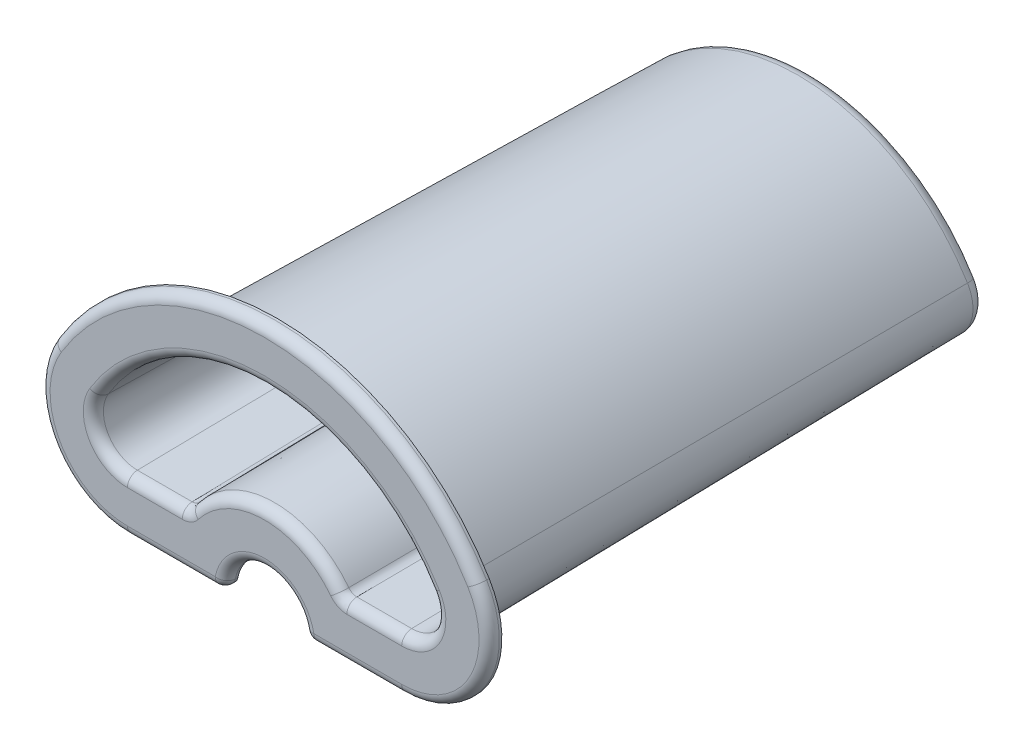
ISO-10303-21;
HEADER;
FILE_DESCRIPTION(('STEP AP214'),'2;1');
FILE_NAME('part.step','',(''),(''),'','','');
FILE_SCHEMA(('AUTOMOTIVE_DESIGN { 1 0 10303 214 1 1 1 1 }'));
ENDSEC;
DATA;
#1=APPLICATION_CONTEXT('core data for automotive mechanical design processes');
#2=APPLICATION_PROTOCOL_DEFINITION('international standard','automotive_design',2000,#1);
#3=PRODUCT_CONTEXT('',#1,'mechanical');
#4=PRODUCT('Part','Part','',(#3));
#5=PRODUCT_RELATED_PRODUCT_CATEGORY('part','',(#4));
#6=PRODUCT_DEFINITION_FORMATION('','',#4);
#7=PRODUCT_DEFINITION_CONTEXT('part definition',#1,'design');
#8=PRODUCT_DEFINITION('design','',#6,#7);
#9=PRODUCT_DEFINITION_SHAPE('','',#8);
#10=(LENGTH_UNIT() NAMED_UNIT(*) SI_UNIT(.MILLI.,.METRE.));
#11=(NAMED_UNIT(*) PLANE_ANGLE_UNIT() SI_UNIT($,.RADIAN.));
#12=(NAMED_UNIT(*) SI_UNIT($,.STERADIAN.) SOLID_ANGLE_UNIT());
#13=UNCERTAINTY_MEASURE_WITH_UNIT(LENGTH_MEASURE(1.E-05),#10,'distance_accuracy_value','');
#14=(GEOMETRIC_REPRESENTATION_CONTEXT(3) GLOBAL_UNCERTAINTY_ASSIGNED_CONTEXT((#13)) GLOBAL_UNIT_ASSIGNED_CONTEXT((#10,
#11,#12)) REPRESENTATION_CONTEXT('',''));
#15=CARTESIAN_POINT('',(0.,0.,0.));
#16=DIRECTION('',(0.,0.,1.));
#17=DIRECTION('',(1.,0.,0.));
#18=AXIS2_PLACEMENT_3D('',#15,#16,#17);
#19=CARTESIAN_POINT('',(0.,2.5037969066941,-105.));
#20=DIRECTION('',(0.,0.,1.));
#21=DIRECTION('',(1.,0.,0.));
#22=AXIS2_PLACEMENT_3D('',#19,#20,#21);
#23=PLANE('',#22);
#24=CARTESIAN_POINT('',(29.7171397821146,16.8730289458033,-105.));
#25=DIRECTION('',(0.,0.,-1.));
#26=DIRECTION('',(-1.,0.,0.));
#27=AXIS2_PLACEMENT_3D('',#24,#25,#26);
#28=CIRCLE('',#27,1.4);
#29=CARTESIAN_POINT('',(29.677855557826,15.473580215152,-105.));
#30=VERTEX_POINT('',#29);
#31=CARTESIAN_POINT('',(31.1169289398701,16.8973253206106,-105.));
#32=VERTEX_POINT('',#31);
#33=EDGE_CURVE('E272',#30,#32,#28,.T.);
#34=ORIENTED_EDGE('',*,*,#33,.F.);
#35=CARTESIAN_POINT('',(27.,19.6194219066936,-105.));
#36=DIRECTION('',(0.,0.,1.));
#37=DIRECTION('',(1.,0.,0.));
#38=AXIS2_PLACEMENT_3D('',#35,#36,#37);
#39=CIRCLE('',#38,4.93547502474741);
#40=CARTESIAN_POINT('',(27.,14.6839468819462,-105.));
#41=VERTEX_POINT('',#40);
#42=EDGE_CURVE('E650',#30,#41,#39,.F.);
#43=ORIENTED_EDGE('',*,*,#42,.T.);
#44=DIRECTION('',(1.,0.,0.));
#45=VECTOR('',#44,1.);
#46=CARTESIAN_POINT('',(0.,14.6839468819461,-105.));
#47=LINE('',#46,#45);
#48=CARTESIAN_POINT('',(16.0898228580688,14.6839468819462,-105.));
#49=VERTEX_POINT('',#48);
#50=EDGE_CURVE('E646',#41,#49,#47,.F.);
#51=ORIENTED_EDGE('',*,*,#50,.T.);
#52=CARTESIAN_POINT('',(0.,2.5037969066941,-105.));
#53=DIRECTION('',(0.,0.,1.));
#54=DIRECTION('',(1.,0.,0.));
#55=AXIS2_PLACEMENT_3D('',#52,#53,#54);
#56=CIRCLE('',#55,20.1801499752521);
#57=CARTESIAN_POINT('',(-16.0898228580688,14.6839468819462,-105.));
#58=VERTEX_POINT('',#57);
#59=EDGE_CURVE('E642',#49,#58,#56,.T.);
#60=ORIENTED_EDGE('',*,*,#59,.T.);
#61=DIRECTION('',(1.,0.,0.));
#62=VECTOR('',#61,1.);
#63=CARTESIAN_POINT('',(-26.9999999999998,14.6839468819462,-105.));
#64=LINE('',#63,#62);
#65=CARTESIAN_POINT('',(-26.9999999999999,14.6839468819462,-105.));
#66=VERTEX_POINT('',#65);
#67=EDGE_CURVE('E644',#58,#66,#64,.F.);
#68=ORIENTED_EDGE('',*,*,#67,.T.);
#69=CARTESIAN_POINT('',(-27.0000000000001,19.619421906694,-105.));
#70=DIRECTION('',(0.,0.,1.));
#71=DIRECTION('',(1.,0.,0.));
#72=AXIS2_PLACEMENT_3D('',#69,#70,#71);
#73=CIRCLE('',#72,4.9354750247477);
#74=CARTESIAN_POINT('',(-31.2196553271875,22.1793872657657,-105.));
#75=VERTEX_POINT('',#74);
#76=EDGE_CURVE('E648',#66,#75,#73,.F.);
#77=ORIENTED_EDGE('',*,*,#76,.T.);
#78=CARTESIAN_POINT('',(0.,3.2391587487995,-105.));
#79=DIRECTION('',(0.,0.,1.));
#80=DIRECTION('',(1.,0.,0.));
#81=AXIS2_PLACEMENT_3D('',#78,#79,#80);
#82=CIRCLE('',#81,36.5157381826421);
#83=CARTESIAN_POINT('',(31.2196553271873,22.1793872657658,-105.));
#84=VERTEX_POINT('',#83);
#85=EDGE_CURVE('E653',#75,#84,#82,.F.);
#86=ORIENTED_EDGE('',*,*,#85,.T.);
#87=EDGE_CURVE('E651',#84,#32,#39,.F.);
#88=ORIENTED_EDGE('',*,*,#87,.T.);
#89=EDGE_LOOP('',(#34,#43,#51,#60,#68,#77,#86,#88));
#90=FACE_BOUND('',#89,.T.);
#91=ADVANCED_FACE('F32',(#90),#23,.F.);
#92=CARTESIAN_POINT('',(0.,2.5037969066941,0.));
#93=DIRECTION('',(0.,0.,-1.));
#94=DIRECTION('',(1.,0.,0.));
#95=AXIS2_PLACEMENT_3D('',#92,#93,#94);
#96=CONICAL_SURFACE('',#95,15.890625,0.0174532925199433);
#97=CARTESIAN_POINT('',(-14.4105156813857,8.98311280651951,80.8538441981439));
#98=CARTESIAN_POINT('',(-13.0229819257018,8.98334742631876,80.8404028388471));
#99=CARTESIAN_POINT('',(-12.2890161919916,10.1608635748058,80.8538441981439));
#100=CARTESIAN_POINT('',(-14.6258264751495,9.37102387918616,58.6304337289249));
#101=CARTESIAN_POINT('',(-13.2582355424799,9.36995915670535,58.6914316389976));
#102=CARTESIAN_POINT('',(-12.5210969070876,10.5218934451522,58.6304337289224));
#103=CARTESIAN_POINT('',(-14.836387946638,9.75893574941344,36.4069775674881));
#104=CARTESIAN_POINT('',(-13.4882589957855,9.75799805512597,36.4606980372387));
#105=CARTESIAN_POINT('',(-12.7479808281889,10.8847144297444,36.4069775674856));
#106=CARTESIAN_POINT('',(-15.249005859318,10.5347608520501,-8.04001279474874));
#107=CARTESIAN_POINT('',(-13.9373134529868,10.5337835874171,-7.98402534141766));
#108=CARTESIAN_POINT('',(-13.1923766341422,11.6133934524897,-8.0400127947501));
#109=CARTESIAN_POINT('',(-15.4510623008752,10.9226740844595,-30.2635469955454));
#110=CARTESIAN_POINT('',(-14.1565967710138,10.9218537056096,-30.2165475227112));
#111=CARTESIAN_POINT('',(-13.409888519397,11.9792514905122,-30.2635469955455));
#112=CARTESIAN_POINT('',(-15.7057908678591,11.420971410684,-58.8109816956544));
#113=CARTESIAN_POINT('',(-14.4326414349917,11.4210876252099,-58.8176396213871));
#114=CARTESIAN_POINT('',(-13.6839315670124,12.4508174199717,-58.8109816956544));
#115=CARTESIAN_POINT('',(-15.7619145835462,11.531354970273,-65.1348515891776));
#116=CARTESIAN_POINT('',(-14.4932985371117,11.5314718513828,-65.1415477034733));
#117=CARTESIAN_POINT('',(-13.7442998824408,12.5553802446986,-65.1348515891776));
#118=CARTESIAN_POINT('',(-15.8735702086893,11.7521221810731,-77.7825966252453));
#119=CARTESIAN_POINT('',(-14.613875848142,11.7522361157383,-77.7891239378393));
#120=CARTESIAN_POINT('',(-13.8643779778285,12.7646995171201,-77.7825966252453));
#121=CARTESIAN_POINT('',(-15.9291021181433,11.8625058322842,-84.1064717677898));
#122=CARTESIAN_POINT('',(-14.6738002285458,11.8626218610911,-84.1131190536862));
#123=CARTESIAN_POINT('',(-13.9240877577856,12.8694559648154,-84.1064717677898));
#124=CARTESIAN_POINT('',(-16.1702247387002,12.3442770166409,-111.707124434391));
#125=CARTESIAN_POINT('',(-14.933364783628,12.3435989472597,-111.66827786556));
#126=CARTESIAN_POINT('',(-14.1833011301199,13.3270659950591,-111.707124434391));
#127=CARTESIAN_POINT('',(-16.3528664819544,12.7156650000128,-132.983927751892));
#128=CARTESIAN_POINT('',(-15.1298559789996,12.7150715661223,-132.949929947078));
#129=CARTESIAN_POINT('',(-14.3795161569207,13.6808631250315,-132.983927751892));
#130=CARTESIAN_POINT('',(-16.7122820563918,13.4584418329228,-175.537584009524));
#131=CARTESIAN_POINT('',(-15.5155726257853,13.457860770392,-175.50429495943));
#132=CARTESIAN_POINT('',(-14.7653758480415,14.3902291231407,-175.537584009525));
#133=CARTESIAN_POINT('',(-16.8890558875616,13.8298306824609,-196.814436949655));
#134=CARTESIAN_POINT('',(-15.7049167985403,13.8293491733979,-196.786851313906));
#135=CARTESIAN_POINT('',(-14.9550205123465,14.7457979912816,-196.814436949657));
#136=CARTESIAN_POINT('',(-17.0631965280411,14.2012199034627,-218.091311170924));
#137=CARTESIAN_POINT('',(-15.8913401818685,14.2013872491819,-218.100898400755));
#138=CARTESIAN_POINT('',(-15.141702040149,15.1021036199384,-218.091311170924));
#139=(BOUNDED_SURFACE() B_SPLINE_SURFACE(3,2,((#97,#98,#99),(#100,#101,#102),(#103,#104,#105),
(#106,#107,#108),(#109,#110,#111),(#112,#113,#114),(#115,#116,#117),(#118,#119,#120),(#121,#122,
#123),(#124,#125,#126),(#127,#128,#129),(#130,#131,#132),(#133,#134,#135),(#136,#137,#138)),
.UNSPECIFIED.,.F.,.F.,.F.) B_SPLINE_SURFACE_WITH_KNOTS((4,2,2,2,2,2,4),(3,3),(0.,
66.6835147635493,133.367026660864,152.342273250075,171.317519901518,235.160003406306,
299.002487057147),(0.,1.),
.UNSPECIFIED.) GEOMETRIC_REPRESENTATION_ITEM() RATIONAL_B_SPLINE_SURFACE(((1.,0.874348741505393,
1.),(1.,0.877421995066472,1.),(1.,0.880275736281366,1.),(1.,0.885614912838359,1.),(1.,
0.888100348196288,1.),(1.,0.891101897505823,1.),(1.,0.891754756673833,1.),(1.,0.893037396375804,
1.),(1.,0.893667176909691,1.),(1.,0.896368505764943,1.),(1.,0.898328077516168,1.),(1.,
0.902038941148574,1.),(1.,0.903790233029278,1.),(1.,0.905456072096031,1.))) REPRESENTATION_ITEM('') SURFACE());
#140=CARTESIAN_POINT('',(-12.2890161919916,10.1608635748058,80.8538441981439));
#141=CARTESIAN_POINT('',(-12.5210969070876,10.5218934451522,58.6304337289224));
#142=CARTESIAN_POINT('',(-12.7479808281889,10.8847144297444,36.4069775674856));
#143=CARTESIAN_POINT('',(-13.1923766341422,11.6133934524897,-8.04001279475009));
#144=CARTESIAN_POINT('',(-13.409888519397,11.9792514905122,-30.2635469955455));
#145=CARTESIAN_POINT('',(-13.6839315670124,12.4508174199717,-58.8109816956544));
#146=CARTESIAN_POINT('',(-13.7442998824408,12.5553802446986,-65.1348515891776));
#147=CARTESIAN_POINT('',(-13.8643779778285,12.7646995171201,-77.7825966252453));
#148=CARTESIAN_POINT('',(-13.9240877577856,12.8694559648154,-84.1064717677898));
#149=CARTESIAN_POINT('',(-14.1833011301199,13.3270659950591,-111.707124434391));
#150=CARTESIAN_POINT('',(-14.3795161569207,13.6808631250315,-132.983927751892));
#151=CARTESIAN_POINT('',(-14.7653758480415,14.3902291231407,-175.537584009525));
#152=CARTESIAN_POINT('',(-14.9550205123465,14.7457979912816,-196.814436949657));
#153=CARTESIAN_POINT('',(-15.141702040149,15.1021036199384,-218.091311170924));
#154=B_SPLINE_CURVE_WITH_KNOTS('',3,(#140,#141,#142,#143,#144,#145,#146,#147,#148,#149,#150,
#151,#152,#153),.UNSPECIFIED.,.F.,.F.,(4,2,2,2,2,2,4),(0.,66.6835147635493,133.367026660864,
152.342273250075,171.317519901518,235.160003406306,299.002487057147),.UNSPECIFIED.);
#155=CARTESIAN_POINT('',(-13.1113543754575,11.481789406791,0.));
#156=VERTEX_POINT('',#155);
#157=CARTESIAN_POINT('',(-14.0968529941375,13.1752496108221,-102.543631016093));
#158=VERTEX_POINT('',#157);
#159=EDGE_CURVE('E509',#156,#158,#154,.T.);
#160=ORIENTED_EDGE('',*,*,#159,.T.);
#161=CARTESIAN_POINT('',(0.,2.5037969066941,-102.543631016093));
#162=DIRECTION('',(0.,0.,1.));
#163=DIRECTION('',(1.,0.,0.));
#164=AXIS2_PLACEMENT_3D('',#161,#162,#163);
#165=CIRCLE('',#164,17.6805307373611);
#166=CARTESIAN_POINT('',(14.0968529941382,13.175249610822,-102.543631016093));
#167=VERTEX_POINT('',#166);
#168=EDGE_CURVE('E668',#158,#167,#165,.F.);
#169=ORIENTED_EDGE('',*,*,#168,.T.);
#170=CARTESIAN_POINT('',(16.7023708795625,13.4397522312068,-174.46685744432));
#171=CARTESIAN_POINT('',(15.5052021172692,13.4399268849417,-174.476863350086));
#172=CARTESIAN_POINT('',(14.7546942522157,14.3726385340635,-174.46685744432));
#173=CARTESIAN_POINT('',(16.5323854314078,13.0848906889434,-154.136853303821));
#174=CARTESIAN_POINT('',(15.3227057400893,13.0844247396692,-154.110159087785));
#175=CARTESIAN_POINT('',(14.5722863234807,14.033231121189,-154.136853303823));
#176=CARTESIAN_POINT('',(16.3598366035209,12.7300295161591,-133.806870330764));
#177=CARTESIAN_POINT('',(15.1373533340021,12.729466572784,-133.774619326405));
#178=CARTESIAN_POINT('',(14.3869994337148,13.6945710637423,-133.806870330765));
#179=CARTESIAN_POINT('',(16.009028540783,12.0203080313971,-93.1469537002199));
#180=CARTESIAN_POINT('',(14.7597582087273,12.0197334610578,-93.1140365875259));
#181=CARTESIAN_POINT('',(14.0100492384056,13.019043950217,-93.1469537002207));
#182=CARTESIAN_POINT('',(15.8307693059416,11.6654477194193,-72.8170200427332));
#183=CARTESIAN_POINT('',(14.5673962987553,11.6647905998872,-72.7793736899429));
#184=CARTESIAN_POINT('',(13.818385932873,12.6821768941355,-72.8170200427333));
#185=CARTESIAN_POINT('',(15.5929343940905,11.2002043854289,-46.1632472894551));
#186=CARTESIAN_POINT('',(14.3105716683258,11.2003227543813,-46.1700286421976));
#187=CARTESIAN_POINT('',(13.5625180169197,12.241894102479,-46.1632472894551));
#188=CARTESIAN_POINT('',(15.5362012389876,11.0898209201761,-39.8393828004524));
#189=CARTESIAN_POINT('',(14.2491546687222,11.0899369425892,-39.8460297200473));
#190=CARTESIAN_POINT('',(13.5014724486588,12.1375338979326,-39.8393828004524));
#191=CARTESIAN_POINT('',(15.4221034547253,10.8690540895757,-27.1916595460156));
#192=CARTESIAN_POINT('',(14.1255369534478,10.8691733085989,-27.1984895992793));
#193=CARTESIAN_POINT('',(13.378681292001,11.9290280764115,-27.1916595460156));
#194=CARTESIAN_POINT('',(15.3647388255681,10.7586707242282,-20.8678007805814));
#195=CARTESIAN_POINT('',(14.0633314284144,10.7587890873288,-20.8745817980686));
#196=CARTESIAN_POINT('',(13.3169357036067,11.824882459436,-20.8678007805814));
#197=CARTESIAN_POINT('',(15.1129517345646,10.2769011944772,6.73275709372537));
#198=CARTESIAN_POINT('',(13.7895338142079,10.2760979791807,6.7787732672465));
#199=CARTESIAN_POINT('',(13.045875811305,11.3708264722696,6.73275709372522));
#200=CARTESIAN_POINT('',(14.915175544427,9.90551556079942,28.009425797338));
#201=CARTESIAN_POINT('',(13.5741339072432,9.90455802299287,28.0642831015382));
#202=CARTESIAN_POINT('',(12.8328482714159,11.0220724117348,28.0094257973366));
#203=CARTESIAN_POINT('',(14.5112919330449,9.16274565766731,70.5626850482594));
#204=CARTESIAN_POINT('',(13.1329699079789,9.16182746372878,70.615288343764));
#205=CARTESIAN_POINT('',(12.3976601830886,10.3276500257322,70.562685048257));
#206=CARTESIAN_POINT('',(14.3051845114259,8.79136138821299,91.8392755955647));
#207=CARTESIAN_POINT('',(12.9069498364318,8.79031809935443,91.8990455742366));
#208=CARTESIAN_POINT('',(12.1754996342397,9.98198170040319,91.8392755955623));
#209=CARTESIAN_POINT('',(14.0944245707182,8.41997791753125,113.11582038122));
#210=CARTESIAN_POINT('',(12.6757790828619,8.42022317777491,113.101769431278));
#211=CARTESIAN_POINT('',(11.9482791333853,9.63813077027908,113.11582038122));
#212=(BOUNDED_SURFACE() B_SPLINE_SURFACE(3,2,((#170,#171,#172),(#173,#174,#175),(#176,#177,
#178),(#179,#180,#181),(#182,#183,#184),(#185,#186,#187),(#188,#189,#190),(#191,#192,#193),
(#194,#195,#196),(#197,#198,#199),(#200,#201,#202),(#203,#204,#205),(#206,#207,#208),(#209,#210,
#211)),.UNSPECIFIED.,.F.,.F.,.F.) B_SPLINE_SURFACE_WITH_KNOTS((4,2,2,2,2,2,4),(3,3),(0.,
61.0014347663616,122.002869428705,140.978116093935,159.953362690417,223.795847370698,
287.638334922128),(0.,1.),
.UNSPECIFIED.) GEOMETRIC_REPRESENTATION_ITEM() RATIONAL_B_SPLINE_SURFACE(((1.,0.901915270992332,
1.),(1.,0.900201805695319,1.),(1.,0.898401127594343,1.),(1.,0.894587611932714,1.),(1.,
0.892574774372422,1.),(1.,0.889772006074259,1.),(1.,0.889094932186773,1.),(1.,0.887715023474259,
1.),(1.,0.887012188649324,1.),(1.,0.883885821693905,1.),(1.,0.881323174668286,1.),(1.,
0.875820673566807,1.),(1.,0.872880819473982,1.),(1.,0.869716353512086,1.))) REPRESENTATION_ITEM('') SURFACE());
#213=CARTESIAN_POINT('',(14.7546942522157,14.3726385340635,-174.46685744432));
#214=CARTESIAN_POINT('',(14.5722863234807,14.033231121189,-154.136853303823));
#215=CARTESIAN_POINT('',(14.3869994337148,13.6945710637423,-133.806870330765));
#216=CARTESIAN_POINT('',(14.0100492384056,13.019043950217,-93.1469537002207));
#217=CARTESIAN_POINT('',(13.818385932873,12.6821768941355,-72.8170200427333));
#218=CARTESIAN_POINT('',(13.5625180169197,12.241894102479,-46.1632472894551));
#219=CARTESIAN_POINT('',(13.5014724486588,12.1375338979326,-39.8393828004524));
#220=CARTESIAN_POINT('',(13.378681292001,11.9290280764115,-27.1916595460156));
#221=CARTESIAN_POINT('',(13.3169357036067,11.824882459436,-20.8678007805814));
#222=CARTESIAN_POINT('',(13.045875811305,11.3708264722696,6.73275709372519));
#223=CARTESIAN_POINT('',(12.8328482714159,11.0220724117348,28.0094257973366));
#224=CARTESIAN_POINT('',(12.3976601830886,10.3276500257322,70.562685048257));
#225=CARTESIAN_POINT('',(12.1754996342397,9.98198170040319,91.8392755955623));
#226=CARTESIAN_POINT('',(11.9482791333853,9.63813077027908,113.11582038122));
#227=B_SPLINE_CURVE_WITH_KNOTS('',3,(#213,#214,#215,#216,#217,#218,#219,#220,#221,#222,#223,
#224,#225,#226),.UNSPECIFIED.,.F.,.F.,(4,2,2,2,2,2,4),(0.,61.0014347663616,122.002869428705,
140.978116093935,159.953362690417,223.795847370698,287.638334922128),.UNSPECIFIED.);
#228=CARTESIAN_POINT('',(13.111354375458,11.4817894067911,0.));
#229=VERTEX_POINT('',#228);
#230=EDGE_CURVE('E612',#167,#229,#227,.T.);
#231=ORIENTED_EDGE('',*,*,#230,.T.);
#232=CARTESIAN_POINT('',(0.,2.5037969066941,0.));
#233=DIRECTION('',(0.,0.,1.));
#234=DIRECTION('',(1.,0.,0.));
#235=AXIS2_PLACEMENT_3D('',#232,#233,#234);
#236=CIRCLE('',#235,15.890625);
#237=EDGE_CURVE('E581',#229,#156,#236,.T.);
#238=ORIENTED_EDGE('',*,*,#237,.T.);
#239=EDGE_LOOP('',(#160,#169,#231,#238));
#240=FACE_BOUND('',#239,.T.);
#241=ADVANCED_FACE('F490',(#240),#96,.F.);
#242=CARTESIAN_POINT('',(-26.9999999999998,10.3944219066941,0.));
#243=DIRECTION('',(0.,-0.999847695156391,-0.0174524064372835));
#244=DIRECTION('',(0.,0.0174524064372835,-0.999847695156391));
#245=AXIS2_PLACEMENT_3D('',#242,#243,#244);
#246=PLANE('',#245);
#247=DIRECTION('',(0.,-0.0174524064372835,0.999847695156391));
#248=VECTOR('',#247,1.);
#249=CARTESIAN_POINT('',(-26.9999999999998,10.3944219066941,0.));
#250=LINE('',#249,#248);
#251=CARTESIAN_POINT('',(-26.9999999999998,12.1843276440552,-102.543631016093));
#252=VERTEX_POINT('',#251);
#253=CARTESIAN_POINT('',(-26.9999999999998,10.3944219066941,0.));
#254=VERTEX_POINT('',#253);
#255=EDGE_CURVE('E605',#252,#254,#250,.T.);
#256=ORIENTED_EDGE('',*,*,#255,.F.);
#257=DIRECTION('',(1.,0.,0.));
#258=VECTOR('',#257,1.);
#259=CARTESIAN_POINT('',(-26.9999999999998,12.1843276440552,-102.543631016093));
#260=LINE('',#259,#258);
#261=CARTESIAN_POINT('',(-16.0898228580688,12.1843276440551,-102.543631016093));
#262=VERTEX_POINT('',#261);
#263=EDGE_CURVE('E662',#252,#262,#260,.T.);
#264=ORIENTED_EDGE('',*,*,#263,.T.);
#265=CARTESIAN_POINT('',(-17.0631965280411,14.2012199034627,-218.091311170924));
#266=CARTESIAN_POINT('',(-16.8890558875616,13.8298306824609,-196.814436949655));
#267=CARTESIAN_POINT('',(-16.7122820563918,13.4584418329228,-175.537584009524));
#268=CARTESIAN_POINT('',(-16.3528664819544,12.7156650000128,-132.983927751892));
#269=CARTESIAN_POINT('',(-16.1702247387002,12.3442770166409,-111.707124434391));
#270=CARTESIAN_POINT('',(-15.9291021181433,11.8625058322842,-84.1064717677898));
#271=CARTESIAN_POINT('',(-15.8735702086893,11.7521221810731,-77.7825966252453));
#272=CARTESIAN_POINT('',(-15.7619145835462,11.531354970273,-65.1348515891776));
#273=CARTESIAN_POINT('',(-15.7057908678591,11.420971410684,-58.8109816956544));
#274=CARTESIAN_POINT('',(-15.4510623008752,10.9226740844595,-30.2635469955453));
#275=CARTESIAN_POINT('',(-15.249005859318,10.5347608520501,-8.04001279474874));
#276=CARTESIAN_POINT('',(-14.836387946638,9.75893574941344,36.406977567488));
#277=CARTESIAN_POINT('',(-14.6258264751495,9.37102387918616,58.6304337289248));
#278=CARTESIAN_POINT('',(-14.4105156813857,8.98311280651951,80.8538441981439));
#279=B_SPLINE_CURVE_WITH_KNOTS('',3,(#265,#266,#267,#268,#269,#270,#271,#272,#273,#274,#275,
#276,#277,#278),.UNSPECIFIED.,.F.,.F.,(4,2,2,2,2,2,4),(0.,63.8424836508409,127.684967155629,
146.660213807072,165.635460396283,232.318972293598,299.002487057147),.UNSPECIFIED.);
#280=CARTESIAN_POINT('',(-15.1737901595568,10.394421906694,0.));
#281=VERTEX_POINT('',#280);
#282=EDGE_CURVE('E607',#262,#281,#279,.T.);
#283=ORIENTED_EDGE('',*,*,#282,.T.);
#284=DIRECTION('',(1.,0.,0.));
#285=VECTOR('',#284,1.);
#286=CARTESIAN_POINT('',(-26.9999999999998,10.3944219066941,0.));
#287=LINE('',#286,#285);
#288=EDGE_CURVE('E584',#254,#281,#287,.T.);
#289=ORIENTED_EDGE('',*,*,#288,.F.);
#290=EDGE_LOOP('',(#256,#264,#283,#289));
#291=FACE_BOUND('',#290,.T.);
#292=ADVANCED_FACE('F496',(#291),#246,.T.);
#293=CARTESIAN_POINT('',(-27.,19.619421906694,0.));
#294=DIRECTION('',(0.,0.,1.));
#295=DIRECTION('',(1.,0.,0.));
#296=AXIS2_PLACEMENT_3D('',#293,#294,#295);
#297=CONICAL_SURFACE('',#296,9.22499999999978,0.0174532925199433);
#298=DIRECTION('',(-0.014921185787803,0.00905233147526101,0.999847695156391));
#299=VECTOR('',#298,1.);
#300=CARTESIAN_POINT('',(-34.8870463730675,24.4043069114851,0.));
#301=LINE('',#300,#299);
#302=CARTESIAN_POINT('',(-33.3567407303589,23.4759065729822,-102.543631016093));
#303=VERTEX_POINT('',#302);
#304=CARTESIAN_POINT('',(-34.8870463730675,24.4043069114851,0.));
#305=VERTEX_POINT('',#304);
#306=EDGE_CURVE('E603',#303,#305,#301,.T.);
#307=ORIENTED_EDGE('',*,*,#306,.F.);
#308=CARTESIAN_POINT('',(-27.0000000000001,19.619421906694,-102.543631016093));
#309=DIRECTION('',(0.,0.,1.));
#310=DIRECTION('',(1.,0.,0.));
#311=AXIS2_PLACEMENT_3D('',#308,#309,#310);
#312=CIRCLE('',#311,7.43509426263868);
#313=EDGE_CURVE('E658',#303,#252,#312,.T.);
#314=ORIENTED_EDGE('',*,*,#313,.T.);
#315=ORIENTED_EDGE('',*,*,#255,.T.);
#316=CARTESIAN_POINT('',(-27.,19.619421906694,0.));
#317=DIRECTION('',(0.,0.,1.));
#318=DIRECTION('',(1.,0.,0.));
#319=AXIS2_PLACEMENT_3D('',#316,#317,#318);
#320=CIRCLE('',#319,9.22499999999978);
#321=EDGE_CURVE('E587',#305,#254,#320,.T.);
#322=ORIENTED_EDGE('',*,*,#321,.F.);
#323=EDGE_LOOP('',(#307,#314,#315,#322));
#324=FACE_BOUND('',#323,.T.);
#325=ADVANCED_FACE('F618',(#324),#297,.T.);
#326=CARTESIAN_POINT('',(0.,3.2391587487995,0.));
#327=DIRECTION('',(0.,0.,1.));
#328=DIRECTION('',(1.,0.,0.));
#329=AXIS2_PLACEMENT_3D('',#326,#327,#328);
#330=CONICAL_SURFACE('',#329,40.8052631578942,0.0174532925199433);
#331=DIRECTION('',(0.0149211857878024,0.00905233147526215,0.999847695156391));
#332=VECTOR('',#331,1.);
#333=CARTESIAN_POINT('',(34.8870463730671,24.4043069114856,0.));
#334=LINE('',#333,#332);
#335=CARTESIAN_POINT('',(33.3567407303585,23.4759065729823,-102.543631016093));
#336=VERTEX_POINT('',#335);
#337=CARTESIAN_POINT('',(34.8870463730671,24.4043069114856,0.));
#338=VERTEX_POINT('',#337);
#339=EDGE_CURVE('E601',#336,#338,#334,.T.);
#340=ORIENTED_EDGE('',*,*,#339,.F.);
#341=CARTESIAN_POINT('',(0.,3.2391587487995,-102.543631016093));
#342=DIRECTION('',(0.,0.,1.));
#343=DIRECTION('',(1.,0.,0.));
#344=AXIS2_PLACEMENT_3D('',#341,#342,#343);
#345=CIRCLE('',#344,39.0153574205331);
#346=EDGE_CURVE('E639',#336,#303,#345,.T.);
#347=ORIENTED_EDGE('',*,*,#346,.T.);
#348=ORIENTED_EDGE('',*,*,#306,.T.);
#349=CARTESIAN_POINT('',(0.,3.2391587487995,0.));
#350=DIRECTION('',(0.,0.,1.));
#351=DIRECTION('',(1.,0.,0.));
#352=AXIS2_PLACEMENT_3D('',#349,#350,#351);
#353=CIRCLE('',#352,40.8052631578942);
#354=EDGE_CURVE('E590',#338,#305,#353,.T.);
#355=ORIENTED_EDGE('',*,*,#354,.F.);
#356=EDGE_LOOP('',(#340,#347,#348,#355));
#357=FACE_BOUND('',#356,.T.);
#358=ADVANCED_FACE('F1220',(#357),#330,.T.);
#359=CARTESIAN_POINT('',(27.,19.6194219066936,0.));
#360=DIRECTION('',(0.,0.,1.));
#361=DIRECTION('',(1.,0.,0.));
#362=AXIS2_PLACEMENT_3D('',#359,#360,#361);
#363=CONICAL_SURFACE('',#362,9.22499999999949,0.0174532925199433);
#364=DIRECTION('',(0.,-0.0174524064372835,0.999847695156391));
#365=VECTOR('',#364,1.);
#366=CARTESIAN_POINT('',(27.,10.3944219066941,0.));
#367=LINE('',#366,#365);
#368=CARTESIAN_POINT('',(27.0000000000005,12.1843276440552,-102.543631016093));
#369=VERTEX_POINT('',#368);
#370=CARTESIAN_POINT('',(27.,10.3944219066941,0.));
#371=VERTEX_POINT('',#370);
#372=EDGE_CURVE('E599',#369,#371,#367,.T.);
#373=ORIENTED_EDGE('',*,*,#372,.F.);
#374=CARTESIAN_POINT('',(27.,19.6194219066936,-102.543631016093));
#375=DIRECTION('',(0.,0.,1.));
#376=DIRECTION('',(1.,0.,0.));
#377=AXIS2_PLACEMENT_3D('',#374,#375,#376);
#378=CIRCLE('',#377,7.43509426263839);
#379=EDGE_CURVE('E656',#369,#336,#378,.T.);
#380=ORIENTED_EDGE('',*,*,#379,.T.);
#381=ORIENTED_EDGE('',*,*,#339,.T.);
#382=CARTESIAN_POINT('',(27.,19.6194219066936,0.));
#383=DIRECTION('',(0.,0.,1.));
#384=DIRECTION('',(1.,0.,0.));
#385=AXIS2_PLACEMENT_3D('',#382,#383,#384);
#386=CIRCLE('',#385,9.22499999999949);
#387=EDGE_CURVE('E593',#371,#338,#386,.T.);
#388=ORIENTED_EDGE('',*,*,#387,.F.);
#389=EDGE_LOOP('',(#373,#380,#381,#388));
#390=FACE_BOUND('',#389,.T.);
#391=ADVANCED_FACE('F856',(#390),#363,.T.);
#392=CARTESIAN_POINT('',(27.,10.3944219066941,0.));
#393=DIRECTION('',(0.,-0.999847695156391,-0.0174524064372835));
#394=DIRECTION('',(0.,0.0174524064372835,-0.999847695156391));
#395=AXIS2_PLACEMENT_3D('',#392,#393,#394);
#396=PLANE('',#395);
#397=CARTESIAN_POINT('',(14.0944245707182,8.41997791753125,113.11582038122));
#398=CARTESIAN_POINT('',(14.3051845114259,8.79136138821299,91.8392755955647));
#399=CARTESIAN_POINT('',(14.5112919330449,9.16274565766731,70.5626850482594));
#400=CARTESIAN_POINT('',(14.915175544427,9.90551556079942,28.009425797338));
#401=CARTESIAN_POINT('',(15.1129517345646,10.2769011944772,6.73275709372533));
#402=CARTESIAN_POINT('',(15.3647388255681,10.7586707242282,-20.8678007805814));
#403=CARTESIAN_POINT('',(15.4221034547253,10.8690540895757,-27.1916595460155));
#404=CARTESIAN_POINT('',(15.5362012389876,11.0898209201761,-39.8393828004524));
#405=CARTESIAN_POINT('',(15.5929343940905,11.2002043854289,-46.1632472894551));
#406=CARTESIAN_POINT('',(15.8307693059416,11.6654477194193,-72.8170200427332));
#407=CARTESIAN_POINT('',(16.009028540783,12.0203080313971,-93.1469537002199));
#408=CARTESIAN_POINT('',(16.3598366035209,12.7300295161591,-133.806870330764));
#409=CARTESIAN_POINT('',(16.5323854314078,13.0848906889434,-154.136853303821));
#410=CARTESIAN_POINT('',(16.7023708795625,13.4397522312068,-174.46685744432));
#411=B_SPLINE_CURVE_WITH_KNOTS('',3,(#397,#398,#399,#400,#401,#402,#403,#404,#405,#406,#407,
#408,#409,#410),.UNSPECIFIED.,.F.,.F.,(4,2,2,2,2,2,4),(0.,63.8424875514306,127.684972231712,
146.660218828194,165.635465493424,226.636900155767,287.638334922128),.UNSPECIFIED.);
#412=CARTESIAN_POINT('',(15.1737901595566,10.3944219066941,0.));
#413=VERTEX_POINT('',#412);
#414=CARTESIAN_POINT('',(16.0898228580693,12.1843276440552,-102.543631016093));
#415=VERTEX_POINT('',#414);
#416=EDGE_CURVE('E623',#413,#415,#411,.T.);
#417=ORIENTED_EDGE('',*,*,#416,.T.);
#418=DIRECTION('',(-1.,0.,0.));
#419=VECTOR('',#418,1.);
#420=CARTESIAN_POINT('',(27.0000000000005,12.1843276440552,-102.543631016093));
#421=LINE('',#420,#419);
#422=EDGE_CURVE('E660',#415,#369,#421,.F.);
#423=ORIENTED_EDGE('',*,*,#422,.T.);
#424=ORIENTED_EDGE('',*,*,#372,.T.);
#425=DIRECTION('',(-1.,0.,0.));
#426=VECTOR('',#425,1.);
#427=CARTESIAN_POINT('',(27.,10.3944219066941,0.));
#428=LINE('',#427,#426);
#429=EDGE_CURVE('E596',#371,#413,#428,.T.);
#430=ORIENTED_EDGE('',*,*,#429,.T.);
#431=EDGE_LOOP('',(#417,#423,#424,#430));
#432=FACE_BOUND('',#431,.T.);
#433=ADVANCED_FACE('F537',(#432),#396,.T.);
#434=CARTESIAN_POINT('',(0.,2.5037969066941,2.49999999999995));
#435=DIRECTION('',(0.,0.,-1.));
#436=DIRECTION('',(-1.,0.,0.));
#437=AXIS2_PLACEMENT_3D('',#434,#435,#436);
#438=CYLINDRICAL_SURFACE('',#437,7.89062500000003);
#439=DIRECTION('',(0.,0.,-1.));
#440=VECTOR('',#439,1.);
#441=CARTESIAN_POINT('',(7.74512350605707,4.01211542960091,2.49999999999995));
#442=LINE('',#441,#440);
#443=CARTESIAN_POINT('',(7.74512350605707,4.01211542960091,0.));
#444=VERTEX_POINT('',#443);
#445=CARTESIAN_POINT('',(7.74512350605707,4.01211542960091,0.499999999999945));
#446=VERTEX_POINT('',#445);
#447=EDGE_CURVE('E678',#444,#446,#442,.F.);
#448=ORIENTED_EDGE('',*,*,#447,.T.);
#449=CARTESIAN_POINT('',(0.,2.5037969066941,0.499999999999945));
#450=DIRECTION('',(0.,0.,1.));
#451=DIRECTION('',(1.,0.,0.));
#452=AXIS2_PLACEMENT_3D('',#449,#450,#451);
#453=CIRCLE('',#452,7.89062500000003);
#454=CARTESIAN_POINT('',(-7.74512350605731,4.01211542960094,0.499999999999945));
#455=VERTEX_POINT('',#454);
#456=EDGE_CURVE('E714',#446,#455,#453,.T.);
#457=ORIENTED_EDGE('',*,*,#456,.T.);
#458=DIRECTION('',(0.,0.,-1.));
#459=VECTOR('',#458,1.);
#460=CARTESIAN_POINT('',(-7.74512350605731,4.01211542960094,2.49999999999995));
#461=LINE('',#460,#459);
#462=CARTESIAN_POINT('',(-7.74512350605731,4.01211542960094,0.));
#463=VERTEX_POINT('',#462);
#464=EDGE_CURVE('E676',#455,#463,#461,.T.);
#465=ORIENTED_EDGE('',*,*,#464,.T.);
#466=CARTESIAN_POINT('',(0.,2.5037969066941,0.));
#467=DIRECTION('',(0.,0.,1.));
#468=DIRECTION('',(1.,0.,0.));
#469=AXIS2_PLACEMENT_3D('',#466,#467,#468);
#470=CIRCLE('',#469,7.89062500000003);
#471=EDGE_CURVE('E553',#444,#463,#470,.T.);
#472=ORIENTED_EDGE('',*,*,#471,.F.);
#473=EDGE_LOOP('',(#448,#457,#465,#472));
#474=FACE_BOUND('',#473,.T.);
#475=ADVANCED_FACE('F403',(#474),#438,.F.);
#476=CARTESIAN_POINT('',(7.88986691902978,2.39442190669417,2.49999999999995));
#477=DIRECTION('',(0.,1.,0.));
#478=DIRECTION('',(-1.,0.,0.));
#479=AXIS2_PLACEMENT_3D('',#476,#477,#478);
#480=PLANE('',#479);
#481=DIRECTION('',(0.,0.,-1.));
#482=VECTOR('',#481,1.);
#483=CARTESIAN_POINT('',(27.0000000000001,2.39442190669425,2.49999999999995));
#484=LINE('',#483,#482);
#485=CARTESIAN_POINT('',(27.0000000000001,2.39442190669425,0.499999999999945));
#486=VERTEX_POINT('',#485);
#487=CARTESIAN_POINT('',(27.0000000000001,2.39442190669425,0.));
#488=VERTEX_POINT('',#487);
#489=EDGE_CURVE('E579',#486,#488,#484,.T.);
#490=ORIENTED_EDGE('',*,*,#489,.F.);
#491=DIRECTION('',(1.,0.,0.));
#492=VECTOR('',#491,1.);
#493=CARTESIAN_POINT('',(-2.42861286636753E-13,2.39442190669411,0.499999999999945));
#494=LINE('',#493,#492);
#495=CARTESIAN_POINT('',(9.70824391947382,2.39442190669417,0.499999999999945));
#496=VERTEX_POINT('',#495);
#497=EDGE_CURVE('E1317',#486,#496,#494,.F.);
#498=ORIENTED_EDGE('',*,*,#497,.T.);
#499=DIRECTION('',(0.,0.,1.));
#500=VECTOR('',#499,1.);
#501=CARTESIAN_POINT('',(9.70824391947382,2.39442190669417,2.49999999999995));
#502=LINE('',#501,#500);
#503=CARTESIAN_POINT('',(9.70824391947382,2.39442190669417,0.));
#504=VERTEX_POINT('',#503);
#505=EDGE_CURVE('E670',#496,#504,#502,.F.);
#506=ORIENTED_EDGE('',*,*,#505,.T.);
#507=DIRECTION('',(1.,0.,0.));
#508=VECTOR('',#507,1.);
#509=CARTESIAN_POINT('',(7.88986691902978,2.39442190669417,0.));
#510=LINE('',#509,#508);
#511=EDGE_CURVE('E570',#504,#488,#510,.T.);
#512=ORIENTED_EDGE('',*,*,#511,.T.);
#513=EDGE_LOOP('',(#490,#498,#506,#512));
#514=FACE_BOUND('',#513,.T.);
#515=ADVANCED_FACE('F500',(#514),#480,.F.);
#516=CARTESIAN_POINT('',(27.,19.6194219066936,2.49999999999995));
#517=DIRECTION('',(0.,0.,-1.));
#518=DIRECTION('',(-1.,0.,0.));
#519=AXIS2_PLACEMENT_3D('',#516,#517,#518);
#520=CYLINDRICAL_SURFACE('',#519,17.2249999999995);
#521=DIRECTION('',(0.,0.,-1.));
#522=VECTOR('',#521,1.);
#523=CARTESIAN_POINT('',(41.7267613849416,28.5538006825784,2.49999999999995));
#524=LINE('',#523,#522);
#525=CARTESIAN_POINT('',(41.7267613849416,28.5538006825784,0.500000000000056));
#526=VERTEX_POINT('',#525);
#527=CARTESIAN_POINT('',(41.7267613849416,28.5538006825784,0.));
#528=VERTEX_POINT('',#527);
#529=EDGE_CURVE('E577',#526,#528,#524,.T.);
#530=ORIENTED_EDGE('',*,*,#529,.F.);
#531=CARTESIAN_POINT('',(27.,19.6194219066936,0.500000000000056));
#532=DIRECTION('',(0.,0.,1.));
#533=DIRECTION('',(1.,0.,0.));
#534=AXIS2_PLACEMENT_3D('',#531,#532,#533);
#535=CIRCLE('',#534,17.2249999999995);
#536=EDGE_CURVE('E1305',#526,#486,#535,.F.);
#537=ORIENTED_EDGE('',*,*,#536,.T.);
#538=ORIENTED_EDGE('',*,*,#489,.T.);
#539=CARTESIAN_POINT('',(27.,19.6194219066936,0.));
#540=DIRECTION('',(0.,0.,1.));
#541=DIRECTION('',(1.,0.,0.));
#542=AXIS2_PLACEMENT_3D('',#539,#540,#541);
#543=CIRCLE('',#542,17.2249999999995);
#544=EDGE_CURVE('E567',#488,#528,#543,.T.);
#545=ORIENTED_EDGE('',*,*,#544,.T.);
#546=EDGE_LOOP('',(#530,#537,#538,#545));
#547=FACE_BOUND('',#546,.T.);
#548=ADVANCED_FACE('F1184',(#547),#520,.T.);
#549=CARTESIAN_POINT('',(0.,3.2391587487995,2.49999999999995));
#550=DIRECTION('',(0.,0.,-1.));
#551=DIRECTION('',(-1.,0.,0.));
#552=AXIS2_PLACEMENT_3D('',#549,#550,#551);
#553=CYLINDRICAL_SURFACE('',#552,48.8052631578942);
#554=DIRECTION('',(0.,0.,-1.));
#555=VECTOR('',#554,1.);
#556=CARTESIAN_POINT('',(-41.7267613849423,28.5538006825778,2.49999999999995));
#557=LINE('',#556,#555);
#558=CARTESIAN_POINT('',(-41.7267613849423,28.5538006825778,0.499999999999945));
#559=VERTEX_POINT('',#558);
#560=CARTESIAN_POINT('',(-41.7267613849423,28.5538006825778,0.));
#561=VERTEX_POINT('',#560);
#562=EDGE_CURVE('E575',#559,#561,#557,.T.);
#563=ORIENTED_EDGE('',*,*,#562,.F.);
#564=CARTESIAN_POINT('',(0.,3.2391587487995,0.499999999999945));
#565=DIRECTION('',(0.,0.,1.));
#566=DIRECTION('',(1.,0.,0.));
#567=AXIS2_PLACEMENT_3D('',#564,#565,#566);
#568=CIRCLE('',#567,48.8052631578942);
#569=EDGE_CURVE('E1301',#559,#526,#568,.F.);
#570=ORIENTED_EDGE('',*,*,#569,.T.);
#571=ORIENTED_EDGE('',*,*,#529,.T.);
#572=CARTESIAN_POINT('',(0.,3.2391587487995,0.));
#573=DIRECTION('',(0.,0.,1.));
#574=DIRECTION('',(1.,0.,0.));
#575=AXIS2_PLACEMENT_3D('',#572,#573,#574);
#576=CIRCLE('',#575,48.8052631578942);
#577=EDGE_CURVE('E564',#528,#561,#576,.T.);
#578=ORIENTED_EDGE('',*,*,#577,.T.);
#579=EDGE_LOOP('',(#563,#570,#571,#578));
#580=FACE_BOUND('',#579,.T.);
#581=ADVANCED_FACE('F1175',(#580),#553,.T.);
#582=CARTESIAN_POINT('',(-27.,19.619421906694,2.49999999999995));
#583=DIRECTION('',(0.,0.,-1.));
#584=DIRECTION('',(-1.,0.,0.));
#585=AXIS2_PLACEMENT_3D('',#582,#583,#584);
#586=CYLINDRICAL_SURFACE('',#585,17.2249999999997);
#587=DIRECTION('',(0.,0.,-1.));
#588=VECTOR('',#587,1.);
#589=CARTESIAN_POINT('',(-26.9999999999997,2.39442190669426,2.49999999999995));
#590=LINE('',#589,#588);
#591=CARTESIAN_POINT('',(-26.9999999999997,2.39442190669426,0.499999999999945));
#592=VERTEX_POINT('',#591);
#593=CARTESIAN_POINT('',(-26.9999999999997,2.39442190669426,0.));
#594=VERTEX_POINT('',#593);
#595=EDGE_CURVE('E573',#592,#594,#590,.T.);
#596=ORIENTED_EDGE('',*,*,#595,.F.);
#597=CARTESIAN_POINT('',(-27.,19.619421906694,0.499999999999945));
#598=DIRECTION('',(0.,0.,1.));
#599=DIRECTION('',(1.,0.,0.));
#600=AXIS2_PLACEMENT_3D('',#597,#598,#599);
#601=CIRCLE('',#600,17.2249999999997);
#602=EDGE_CURVE('E1289',#592,#559,#601,.F.);
#603=ORIENTED_EDGE('',*,*,#602,.T.);
#604=ORIENTED_EDGE('',*,*,#562,.T.);
#605=CARTESIAN_POINT('',(-27.,19.619421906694,0.));
#606=DIRECTION('',(0.,0.,1.));
#607=DIRECTION('',(1.,0.,0.));
#608=AXIS2_PLACEMENT_3D('',#605,#606,#607);
#609=CIRCLE('',#608,17.2249999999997);
#610=EDGE_CURVE('E561',#561,#594,#609,.T.);
#611=ORIENTED_EDGE('',*,*,#610,.T.);
#612=EDGE_LOOP('',(#596,#603,#604,#611));
#613=FACE_BOUND('',#612,.T.);
#614=ADVANCED_FACE('F400',(#613),#586,.T.);
#615=CARTESIAN_POINT('',(-26.9999999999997,2.3944219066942,2.49999999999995));
#616=DIRECTION('',(0.,1.,0.));
#617=DIRECTION('',(-1.,0.,0.));
#618=AXIS2_PLACEMENT_3D('',#615,#616,#617);
#619=PLANE('',#618);
#620=DIRECTION('',(0.,0.,1.));
#621=VECTOR('',#620,1.);
#622=CARTESIAN_POINT('',(-9.70824391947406,2.39442190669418,2.49999999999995));
#623=LINE('',#622,#621);
#624=CARTESIAN_POINT('',(-9.70824391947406,2.39442190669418,0.));
#625=VERTEX_POINT('',#624);
#626=CARTESIAN_POINT('',(-9.70824391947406,2.39442190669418,0.499999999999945));
#627=VERTEX_POINT('',#626);
#628=EDGE_CURVE('E681',#625,#627,#623,.T.);
#629=ORIENTED_EDGE('',*,*,#628,.T.);
#630=DIRECTION('',(1.,0.,0.));
#631=VECTOR('',#630,1.);
#632=CARTESIAN_POINT('',(-2.4980018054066E-13,2.39442190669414,0.499999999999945));
#633=LINE('',#632,#631);
#634=EDGE_CURVE('E1286',#627,#592,#633,.F.);
#635=ORIENTED_EDGE('',*,*,#634,.T.);
#636=ORIENTED_EDGE('',*,*,#595,.T.);
#637=DIRECTION('',(1.,0.,0.));
#638=VECTOR('',#637,1.);
#639=CARTESIAN_POINT('',(-26.9999999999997,2.3944219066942,0.));
#640=LINE('',#639,#638);
#641=EDGE_CURVE('E558',#594,#625,#640,.T.);
#642=ORIENTED_EDGE('',*,*,#641,.T.);
#643=EDGE_LOOP('',(#629,#635,#636,#642));
#644=FACE_BOUND('',#643,.T.);
#645=ADVANCED_FACE('F398',(#644),#619,.F.);
#646=CARTESIAN_POINT('',(0.,2.5037969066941,2.49999999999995));
#647=DIRECTION('',(0.,0.,1.));
#648=DIRECTION('',(1.,0.,0.));
#649=AXIS2_PLACEMENT_3D('',#646,#647,#648);
#650=PLANE('',#649);
#651=CARTESIAN_POINT('',(-27.,19.619421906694,2.49999999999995));
#652=DIRECTION('',(0.,0.,1.));
#653=DIRECTION('',(1.,0.,0.));
#654=AXIS2_PLACEMENT_3D('',#651,#652,#653);
#655=CIRCLE('',#654,15.2249999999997);
#656=CARTESIAN_POINT('',(-40.0168326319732,27.5164272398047,2.49999999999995));
#657=VERTEX_POINT('',#656);
#658=CARTESIAN_POINT('',(-26.9999999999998,4.39442190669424,2.49999999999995));
#659=VERTEX_POINT('',#658);
#660=EDGE_CURVE('E1307',#657,#659,#655,.T.);
#661=ORIENTED_EDGE('',*,*,#660,.T.);
#662=DIRECTION('',(1.,0.,0.));
#663=VECTOR('',#662,1.);
#664=CARTESIAN_POINT('',(0.,4.39442190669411,2.49999999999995));
#665=LINE('',#664,#663);
#666=CARTESIAN_POINT('',(-9.70824391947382,4.39442190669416,2.49999999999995));
#667=VERTEX_POINT('',#666);
#668=EDGE_CURVE('E1285',#659,#667,#665,.T.);
#669=ORIENTED_EDGE('',*,*,#668,.T.);
#670=CARTESIAN_POINT('',(0.,2.5037969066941,2.49999999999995));
#671=DIRECTION('',(0.,0.,1.));
#672=DIRECTION('',(1.,0.,0.));
#673=AXIS2_PLACEMENT_3D('',#670,#671,#672);
#674=CIRCLE('',#673,9.89062500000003);
#675=CARTESIAN_POINT('',(9.70824391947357,4.39442190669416,2.49999999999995));
#676=VERTEX_POINT('',#675);
#677=EDGE_CURVE('E1277',#667,#676,#674,.F.);
#678=ORIENTED_EDGE('',*,*,#677,.T.);
#679=DIRECTION('',(1.,0.,0.));
#680=VECTOR('',#679,1.);
#681=CARTESIAN_POINT('',(0.,4.39442190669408,2.49999999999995));
#682=LINE('',#681,#680);
#683=CARTESIAN_POINT('',(27.0000000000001,4.39442190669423,2.49999999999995));
#684=VERTEX_POINT('',#683);
#685=EDGE_CURVE('E1319',#676,#684,#682,.T.);
#686=ORIENTED_EDGE('',*,*,#685,.T.);
#687=CARTESIAN_POINT('',(27.,19.6194219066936,2.49999999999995));
#688=DIRECTION('',(0.,0.,1.));
#689=DIRECTION('',(1.,0.,0.));
#690=AXIS2_PLACEMENT_3D('',#687,#688,#689);
#691=CIRCLE('',#690,15.2249999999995);
#692=CARTESIAN_POINT('',(40.016832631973,27.5164272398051,2.49999999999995));
#693=VERTEX_POINT('',#692);
#694=EDGE_CURVE('E1311',#684,#693,#691,.T.);
#695=ORIENTED_EDGE('',*,*,#694,.T.);
#696=CARTESIAN_POINT('',(0.,3.2391587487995,2.49999999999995));
#697=DIRECTION('',(0.,0.,1.));
#698=DIRECTION('',(1.,0.,0.));
#699=AXIS2_PLACEMENT_3D('',#696,#697,#698);
#700=CIRCLE('',#699,46.8052631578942);
#701=EDGE_CURVE('E1308',#693,#657,#700,.T.);
#702=ORIENTED_EDGE('',*,*,#701,.T.);
#703=EDGE_LOOP('',(#661,#669,#678,#686,#695,#702));
#704=FACE_BOUND('',#703,.T.);
#705=DIRECTION('',(-1.,0.,0.));
#706=VECTOR('',#705,1.);
#707=CARTESIAN_POINT('',(0.,10.9290273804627,2.49999999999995));
#708=LINE('',#707,#706);
#709=CARTESIAN_POINT('',(27.,10.9290273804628,2.49999999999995));
#710=VERTEX_POINT('',#709);
#711=CARTESIAN_POINT('',(16.210920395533,10.9290273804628,2.49999999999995));
#712=VERTEX_POINT('',#711);
#713=EDGE_CURVE('E752',#710,#712,#708,.T.);
#714=ORIENTED_EDGE('',*,*,#713,.T.);
#715=CARTESIAN_POINT('',(17.615054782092,15.8972362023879,-169.531115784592));
#716=CARTESIAN_POINT('',(16.7069362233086,15.8973618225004,-169.538312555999));
#717=CARTESIAN_POINT('',(16.1092820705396,16.581093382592,-169.531115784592));
#718=CARTESIAN_POINT('',(17.4571056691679,15.5494728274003,-149.60776537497));
#719=CARTESIAN_POINT('',(16.5406011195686,15.5490858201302,-149.585593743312));
#720=CARTESIAN_POINT('',(15.9424489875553,16.2435010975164,-149.60776537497));
#721=CARTESIAN_POINT('',(17.2970517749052,15.2017097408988,-129.684431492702));
#722=CARTESIAN_POINT('',(16.3720359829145,15.2012565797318,-129.658469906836));
#723=CARTESIAN_POINT('',(15.7732966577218,15.9063531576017,-129.684431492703));
#724=CARTESIAN_POINT('',(16.9723239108,14.5061842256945,-89.8378014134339));
#725=CARTESIAN_POINT('',(16.0296110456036,14.5057239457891,-89.8114319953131));
#726=CARTESIAN_POINT('',(15.429914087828,15.2330999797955,-89.8378014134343));
#727=CARTESIAN_POINT('',(16.8076499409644,14.1584217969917,-69.9145052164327));
#728=CARTESIAN_POINT('',(15.8556757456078,14.1579042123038,-69.8848528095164));
#729=CARTESIAN_POINT('',(15.2556838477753,14.8969947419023,-69.9145052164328));
#730=CARTESIAN_POINT('',(16.5818948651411,13.6888399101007,-43.0121769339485));
#731=CARTESIAN_POINT('',(15.6171736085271,13.6889015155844,-43.0157063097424));
#732=CARTESIAN_POINT('',(15.0166963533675,14.4439609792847,-43.0121769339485));
#733=CARTESIAN_POINT('',(16.5230204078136,13.567020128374,-36.0331263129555));
#734=CARTESIAN_POINT('',(15.5548604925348,13.5670792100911,-36.0365111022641));
#735=CARTESIAN_POINT('',(14.9543592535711,14.3265075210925,-36.0331263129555));
#736=CARTESIAN_POINT('',(16.4046325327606,13.3233806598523,-22.0750305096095));
#737=CARTESIAN_POINT('',(15.4294870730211,13.3234419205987,-22.0785401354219));
#738=CARTESIAN_POINT('',(14.8289851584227,14.0917560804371,-22.0750305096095));
#739=CARTESIAN_POINT('',(16.3451191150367,13.2015609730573,-15.0959853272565));
#740=CARTESIAN_POINT('',(15.3664225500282,13.2016207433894,-15.0994095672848));
#741=CARTESIAN_POINT('',(14.7659481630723,13.9744580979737,-15.0959853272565));
#742=CARTESIAN_POINT('',(16.1062486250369,12.7152985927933,12.7619677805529));
#743=CARTESIAN_POINT('',(15.1127834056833,12.7146661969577,12.7981977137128));
#744=CARTESIAN_POINT('',(14.5128885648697,13.5065694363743,12.7619677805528));
#745=CARTESIAN_POINT('',(15.9242759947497,12.3508562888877,33.6408533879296));
#746=CARTESIAN_POINT('',(14.919408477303,12.3501214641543,33.6829514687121));
#747=CARTESIAN_POINT('',(14.3200030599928,13.1566256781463,33.640853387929));
#748=CARTESIAN_POINT('',(15.553780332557,11.621972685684,75.3985670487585));
#749=CARTESIAN_POINT('',(14.5250021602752,11.62126120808,75.4393275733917));
#750=CARTESIAN_POINT('',(13.9270958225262,12.458468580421,75.3985670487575));
#751=CARTESIAN_POINT('',(15.3652573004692,11.2575313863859,96.2773951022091));
#752=CARTESIAN_POINT('',(14.3238187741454,11.2567346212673,96.3230417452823));
#753=CARTESIAN_POINT('',(13.7270740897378,12.1102552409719,96.2773951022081));
#754=CARTESIAN_POINT('',(15.1731284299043,10.8930906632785,117.15619014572));
#755=CARTESIAN_POINT('',(14.1188825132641,10.893259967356,117.14649072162));
#756=CARTESIAN_POINT('',(13.5231391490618,11.7630440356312,117.15619014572));
#757=(BOUNDED_SURFACE() B_SPLINE_SURFACE(3,2,((#715,#716,#717),(#718,#719,#720),(#721,#722,
#723),(#724,#725,#726),(#727,#728,#729),(#730,#731,#732),(#733,#734,#735),(#736,#737,#738),
(#739,#740,#741),(#742,#743,#744),(#745,#746,#747),(#748,#749,#750),(#751,#752,#753),(#754,#755,
#756)),.UNSPECIFIED.,.F.,.F.,.F.) B_SPLINE_SURFACE_WITH_KNOTS((4,2,2,2,2,2,4),(3,3),(0.,
59.7810340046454,119.5620679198,140.503153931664,161.44423989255,224.092815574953,
286.741393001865),(0.,1.),
.UNSPECIFIED.) GEOMETRIC_REPRESENTATION_ITEM() RATIONAL_B_SPLINE_SURFACE(((1.,0.910528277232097,
1.),(1.,0.909132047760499,1.),(1.,0.907671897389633,1.),(1.,0.904600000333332,1.),(1.,
0.902988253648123,1.),(1.,0.90069352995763,1.),(1.,0.900087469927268,1.),(1.,0.89885248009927,
1.),(1.,0.898223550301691,1.),(1.,0.895665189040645,1.),(1.,0.893640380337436,1.),(1.,
0.889332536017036,1.),(1.,0.887049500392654,1.),(1.,0.88461561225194,1.))) REPRESENTATION_ITEM('') SURFACE());
#758=CARTESIAN_POINT('',(12.4101458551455,13.6836391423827,2.49999999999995));
#759=CARTESIAN_POINT('',(14.2850662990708,14.2977986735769,2.50000000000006));
#760=CARTESIAN_POINT('',(14.3105999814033,14.30616263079,0.527236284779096));
#761=CARTESIAN_POINT('',(12.4451832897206,13.5766799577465,2.49999999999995));
#762=CARTESIAN_POINT('',(14.3020864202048,14.2433609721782,2.5));
#763=CARTESIAN_POINT('',(14.3281117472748,14.2526693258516,0.528018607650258));
#764=CARTESIAN_POINT('',(12.4847190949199,13.4712510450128,2.49999999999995));
#765=CARTESIAN_POINT('',(14.32144146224,14.1896360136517,2.49999999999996));
#766=CARTESIAN_POINT('',(14.3478730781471,14.1999417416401,0.528768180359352));
#767=CARTESIAN_POINT('',(12.5725247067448,13.264101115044,2.49999999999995));
#768=CARTESIAN_POINT('',(14.3646924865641,14.0839900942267,2.49999999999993));
#769=CARTESIAN_POINT('',(14.391763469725,14.0963417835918,0.530197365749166));
#770=CARTESIAN_POINT('',(12.6207941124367,13.1623799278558,2.49999999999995));
#771=CARTESIAN_POINT('',(14.388587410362,14.0320665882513,2.49999999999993));
#772=CARTESIAN_POINT('',(14.4158923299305,14.0454693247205,0.530876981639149));
#773=CARTESIAN_POINT('',(12.7781292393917,12.8640848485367,2.49999999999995));
#774=CARTESIAN_POINT('',(14.4667973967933,13.8797254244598,2.49999999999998));
#775=CARTESIAN_POINT('',(14.4945434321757,13.8962882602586,0.532802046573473));
#776=CARTESIAN_POINT('',(12.8998471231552,12.6739983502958,2.49999999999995));
#777=CARTESIAN_POINT('',(14.5277207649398,13.7824798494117,2.50000000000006));
#778=CARTESIAN_POINT('',(14.5553927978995,13.8012253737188,0.533936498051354));
#779=CARTESIAN_POINT('',(13.1734300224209,12.317013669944,2.49999999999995));
#780=CARTESIAN_POINT('',(14.6653571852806,13.5997555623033,2.50000000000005));
#781=CARTESIAN_POINT('',(14.6921675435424,13.6226992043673,0.535873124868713));
#782=CARTESIAN_POINT('',(13.3253015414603,12.1501205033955,2.49999999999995));
#783=CARTESIAN_POINT('',(14.7420774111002,13.5142588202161,2.49999999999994));
#784=CARTESIAN_POINT('',(14.7680961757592,13.5392384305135,0.536675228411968));
#785=CARTESIAN_POINT('',(13.6549340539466,11.8441640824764,2.49999999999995));
#786=CARTESIAN_POINT('',(14.909081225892,13.35757583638,2.49999999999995));
#787=CARTESIAN_POINT('',(14.9329015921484,13.3862383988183,0.537925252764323));
#788=CARTESIAN_POINT('',(13.8326961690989,11.705102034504,2.49999999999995));
#789=CARTESIAN_POINT('',(14.9993757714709,13.2863721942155,2.50000000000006));
#790=CARTESIAN_POINT('',(15.0217789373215,13.3166997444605,0.538373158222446));
#791=CARTESIAN_POINT('',(14.2090883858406,11.4587650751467,2.49999999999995));
#792=CARTESIAN_POINT('',(15.1908552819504,13.160434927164,2.50000000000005));
#793=CARTESIAN_POINT('',(15.2099705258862,13.1935220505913,0.538901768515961));
#794=CARTESIAN_POINT('',(14.4077255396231,11.3515009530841,2.49999999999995));
#795=CARTESIAN_POINT('',(15.2920597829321,13.1056933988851,2.49999999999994));
#796=CARTESIAN_POINT('',(15.3092882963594,13.1398884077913,0.538982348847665));
#797=CARTESIAN_POINT('',(14.820109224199,11.1719136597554,2.49999999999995));
#798=CARTESIAN_POINT('',(15.5022648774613,13.0143756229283,2.49999999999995));
#799=CARTESIAN_POINT('',(15.5154818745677,13.050098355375,0.538773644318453));
#800=CARTESIAN_POINT('',(15.0338448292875,11.099565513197,2.49999999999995));
#801=CARTESIAN_POINT('',(15.6112792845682,12.9777790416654,2.50000000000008));
#802=CARTESIAN_POINT('',(15.6223522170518,13.0139294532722,0.538484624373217));
#803=CARTESIAN_POINT('',(15.408777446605,11.006959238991,2.49999999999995));
#804=CARTESIAN_POINT('',(15.8024289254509,12.9313804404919,2.50000000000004));
#805=CARTESIAN_POINT('',(15.809825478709,12.9676403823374,0.537678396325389));
#806=CARTESIAN_POINT('',(15.5678280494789,10.9777709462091,2.49999999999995));
#807=CARTESIAN_POINT('',(15.8835061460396,12.9169344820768,2.49999999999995));
#808=CARTESIAN_POINT('',(15.8893544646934,12.9530536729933,0.537248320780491));
#809=CARTESIAN_POINT('',(15.88819394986,10.9388040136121,2.49999999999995));
#810=CARTESIAN_POINT('',(16.0467076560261,12.8981122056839,2.49999999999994));
#811=CARTESIAN_POINT('',(16.0495463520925,12.9335882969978,0.536209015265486));
#812=CARTESIAN_POINT('',(16.0495081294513,10.9290161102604,2.49999999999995));
#813=CARTESIAN_POINT('',(16.1288389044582,12.8937328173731,2.50000000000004));
#814=CARTESIAN_POINT('',(16.1302086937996,12.9287049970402,0.535599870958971));
#815=CARTESIAN_POINT('',(16.4354093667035,10.9290430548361,2.49999999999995));
#816=CARTESIAN_POINT('',(16.3251253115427,12.8953806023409,2.50000000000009));
#817=CARTESIAN_POINT('',(16.3231736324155,12.9287474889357,0.533938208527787));
#818=CARTESIAN_POINT('',(16.6600880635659,10.9480129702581,2.49999999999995));
#819=CARTESIAN_POINT('',(16.4392503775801,12.9061514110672,2.49999999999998));
#820=CARTESIAN_POINT('',(16.4355227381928,12.938252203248,0.532805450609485));
#821=CARTESIAN_POINT('',(16.992452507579,11.0044959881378,2.49999999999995));
#822=CARTESIAN_POINT('',(16.6076895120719,12.9366966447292,2.49999999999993));
#823=CARTESIAN_POINT('',(16.6017215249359,12.9665273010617,0.530881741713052));
#824=CARTESIAN_POINT('',(17.1027039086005,11.0280785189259,2.49999999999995));
#825=CARTESIAN_POINT('',(16.6635141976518,12.9493257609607,2.49999999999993));
#826=CARTESIAN_POINT('',(16.6568530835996,12.9783304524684,0.53020131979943));
#827=CARTESIAN_POINT('',(17.3208062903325,11.0844500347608,2.49999999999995));
#828=CARTESIAN_POINT('',(16.7738144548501,12.979290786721,2.49999999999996));
#829=CARTESIAN_POINT('',(16.7659166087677,13.0065411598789,0.528770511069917));
#830=CARTESIAN_POINT('',(17.4286577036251,11.1172373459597,2.49999999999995));
#831=CARTESIAN_POINT('',(16.8282917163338,12.9966280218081,2.5));
#832=CARTESIAN_POINT('',(16.8198487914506,13.0229478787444,0.528020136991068));
#833=CARTESIAN_POINT('',(17.5349945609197,11.1545356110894,2.49999999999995));
#834=CARTESIAN_POINT('',(16.881917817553,13.0162570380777,2.50000000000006));
#835=CARTESIAN_POINT('',(16.8730239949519,13.0416105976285,0.527236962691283));
#836=(BOUNDED_SURFACE() B_SPLINE_SURFACE(3,2,((#758,#759,#760),(#761,#762,#763),(#764,#765,
#766),(#767,#768,#769),(#770,#771,#772),(#773,#774,#775),(#776,#777,#778),(#779,#780,#781),
(#782,#783,#784),(#785,#786,#787),(#788,#789,#790),(#791,#792,#793),(#794,#795,#796),(#797,#798,
#799),(#800,#801,#802),(#803,#804,#805),(#806,#807,#808),(#809,#810,#811),(#812,#813,#814),
(#815,#816,#817),(#818,#819,#820),(#821,#822,#823),(#824,#825,#826),(#827,#828,#829),(#830,#831,
#832),(#833,#834,#835)),.UNSPECIFIED.,.F.,.F.,.F.) B_SPLINE_SURFACE_WITH_KNOTS((4,2,2,2,2,2,2,2,
2,2,2,2,4),(3,3),(0.,0.337447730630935,0.674879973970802,1.3485563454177,2.02237817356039,
2.69622920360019,3.37030861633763,4.04390514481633,4.5278928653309,5.01164942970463,
5.68444844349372,6.02234722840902,6.3601846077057),(0.,1.),
.UNSPECIFIED.) GEOMETRIC_REPRESENTATION_ITEM() RATIONAL_B_SPLINE_SURFACE(((1.,0.71190523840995,
1.),(1.,0.712042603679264,1.),(1.,0.712174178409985,1.),(1.,0.712424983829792,1.),(1.,
0.712544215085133,1.),(1.,0.71288187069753,1.),(1.,0.713080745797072,1.),(1.,0.713420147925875,
1.),(1.,0.713560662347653,1.),(1.,0.713779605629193,1.),(1.,0.713858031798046,1.),(1.,
0.713950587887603,1.),(1.,0.713964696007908,1.),(1.,0.713928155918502,1.),(1.,0.713877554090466,
1.),(1.,0.713736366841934,1.),(1.,0.71366104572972,1.),(1.,0.713478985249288,1.),(1.,
0.713372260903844,1.),(1.,0.713081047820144,1.),(1.,0.712882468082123,1.),(1.,0.712545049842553,
1.),(1.,0.712425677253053,1.),(1.,0.71217458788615,1.),(1.,0.712042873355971,1.),(1.,
0.711905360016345,1.))) REPRESENTATION_ITEM('') SURFACE());
#837=CARTESIAN_POINT('',(17.5349945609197,11.1545356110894,2.49999999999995));
#838=CARTESIAN_POINT('',(17.4286577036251,11.1172373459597,2.49999999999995));
#839=CARTESIAN_POINT('',(17.3208062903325,11.0844500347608,2.49999999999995));
#840=CARTESIAN_POINT('',(17.1027039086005,11.0280785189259,2.49999999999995));
#841=CARTESIAN_POINT('',(16.992452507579,11.0044959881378,2.49999999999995));
#842=CARTESIAN_POINT('',(16.6600880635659,10.9480129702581,2.49999999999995));
#843=CARTESIAN_POINT('',(16.4354093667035,10.9290430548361,2.49999999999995));
#844=CARTESIAN_POINT('',(16.0495081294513,10.9290161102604,2.49999999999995));
#845=CARTESIAN_POINT('',(15.88819394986,10.9388040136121,2.49999999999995));
#846=CARTESIAN_POINT('',(15.5678280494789,10.9777709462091,2.49999999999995));
#847=CARTESIAN_POINT('',(15.408777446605,11.006959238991,2.49999999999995));
#848=CARTESIAN_POINT('',(15.0338448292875,11.099565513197,2.49999999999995));
#849=CARTESIAN_POINT('',(14.820109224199,11.1719136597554,2.49999999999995));
#850=CARTESIAN_POINT('',(14.4077255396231,11.3515009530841,2.49999999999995));
#851=CARTESIAN_POINT('',(14.2090883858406,11.4587650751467,2.49999999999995));
#852=CARTESIAN_POINT('',(13.8326961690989,11.705102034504,2.49999999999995));
#853=CARTESIAN_POINT('',(13.6549340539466,11.8441640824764,2.49999999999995));
#854=CARTESIAN_POINT('',(13.3253015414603,12.1501205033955,2.49999999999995));
#855=CARTESIAN_POINT('',(13.1734300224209,12.317013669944,2.49999999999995));
#856=CARTESIAN_POINT('',(12.8998471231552,12.6739983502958,2.49999999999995));
#857=CARTESIAN_POINT('',(12.7781292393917,12.8640848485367,2.49999999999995));
#858=CARTESIAN_POINT('',(12.6207941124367,13.1623799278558,2.49999999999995));
#859=CARTESIAN_POINT('',(12.5725247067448,13.264101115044,2.49999999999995));
#860=CARTESIAN_POINT('',(12.4847190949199,13.4712510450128,2.49999999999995));
#861=CARTESIAN_POINT('',(12.4451832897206,13.5766799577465,2.49999999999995));
#862=CARTESIAN_POINT('',(12.4101458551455,13.6836391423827,2.49999999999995));
#863=B_SPLINE_CURVE_WITH_KNOTS('',3,(#837,#838,#839,#840,#841,#842,#843,#844,#845,#846,#847,
#848,#849,#850,#851,#852,#853,#854,#855,#856,#857,#858,#859,#860,#861,#862),.UNSPECIFIED.,.F.,
.F.,(4,2,2,2,2,2,2,2,2,2,2,2,4),(0.,0.337837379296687,0.675736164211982,1.34853517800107,
1.83229174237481,2.31627946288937,2.98987599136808,3.66395540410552,4.33780643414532,
5.01162826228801,5.6853046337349,6.02273687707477,6.3601846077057),.UNSPECIFIED.);
#864=CARTESIAN_POINT('',(13.0366238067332,12.4955252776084,2.49999999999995));
#865=VERTEX_POINT('',#864);
#866=EDGE_CURVE('E408',#712,#865,#863,.T.);
#867=ORIENTED_EDGE('',*,*,#866,.T.);
#868=CARTESIAN_POINT('',(0.,2.5037969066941,2.49999999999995));
#869=DIRECTION('',(0.,0.,1.));
#870=DIRECTION('',(1.,0.,0.));
#871=AXIS2_PLACEMENT_3D('',#868,#869,#870);
#872=CIRCLE('',#871,16.4252304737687);
#873=CARTESIAN_POINT('',(-13.0366238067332,12.4955252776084,2.49999999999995));
#874=VERTEX_POINT('',#873);
#875=EDGE_CURVE('E703',#865,#874,#872,.T.);
#876=ORIENTED_EDGE('',*,*,#875,.T.);
#877=CARTESIAN_POINT('',(-16.1092820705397,16.5810933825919,-169.531115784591));
#878=CARTESIAN_POINT('',(-16.7069362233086,15.8973618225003,-169.538312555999));
#879=CARTESIAN_POINT('',(-17.615054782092,15.897236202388,-169.531115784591));
#880=CARTESIAN_POINT('',(-15.9424489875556,16.243501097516,-149.60776537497));
#881=CARTESIAN_POINT('',(-16.5406011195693,15.5490858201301,-149.585593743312));
#882=CARTESIAN_POINT('',(-17.4571056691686,15.5494728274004,-149.60776537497));
#883=CARTESIAN_POINT('',(-15.7732966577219,15.9063531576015,-129.684431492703));
#884=CARTESIAN_POINT('',(-16.3720359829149,15.2012565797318,-129.658469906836));
#885=CARTESIAN_POINT('',(-17.2970517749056,15.2017097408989,-129.684431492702));
#886=CARTESIAN_POINT('',(-15.4299140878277,15.2330999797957,-89.8378014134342));
#887=CARTESIAN_POINT('',(-16.0296110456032,14.5057239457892,-89.8114319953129));
#888=CARTESIAN_POINT('',(-16.9723239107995,14.5061842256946,-89.8378014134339));
#889=CARTESIAN_POINT('',(-15.2556838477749,14.8969947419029,-69.9145052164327));
#890=CARTESIAN_POINT('',(-15.8556757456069,14.157904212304,-69.8848528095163));
#891=CARTESIAN_POINT('',(-16.8076499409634,14.1584217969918,-69.9145052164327));
#892=CARTESIAN_POINT('',(-15.0166963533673,14.4439609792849,-43.0121769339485));
#893=CARTESIAN_POINT('',(-15.6171736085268,13.6889015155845,-43.0157063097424));
#894=CARTESIAN_POINT('',(-16.5818948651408,13.6888399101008,-43.0121769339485));
#895=CARTESIAN_POINT('',(-14.9543592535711,14.3265075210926,-36.0331263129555));
#896=CARTESIAN_POINT('',(-15.5548604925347,13.5670792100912,-36.0365111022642));
#897=CARTESIAN_POINT('',(-16.5230204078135,13.567020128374,-36.0331263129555));
#898=CARTESIAN_POINT('',(-14.8289851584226,14.0917560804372,-22.0750305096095));
#899=CARTESIAN_POINT('',(-15.4294870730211,13.3234419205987,-22.0785401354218));
#900=CARTESIAN_POINT('',(-16.4046325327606,13.3233806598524,-22.0750305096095));
#901=CARTESIAN_POINT('',(-14.7659481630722,13.9744580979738,-15.0959853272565));
#902=CARTESIAN_POINT('',(-15.3664225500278,13.2016207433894,-15.0994095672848));
#903=CARTESIAN_POINT('',(-16.3451191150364,13.2015609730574,-15.0959853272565));
#904=CARTESIAN_POINT('',(-14.5128885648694,13.5065694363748,12.7619677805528));
#905=CARTESIAN_POINT('',(-15.1127834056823,12.7146661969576,12.7981977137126));
#906=CARTESIAN_POINT('',(-16.1062486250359,12.7152985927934,12.7619677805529));
#907=CARTESIAN_POINT('',(-14.3200030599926,13.1566256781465,33.640853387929));
#908=CARTESIAN_POINT('',(-14.9194084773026,12.3501214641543,33.6829514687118));
#909=CARTESIAN_POINT('',(-15.9242759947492,12.3508562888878,33.6408533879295));
#910=CARTESIAN_POINT('',(-13.9270958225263,12.4584685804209,75.3985670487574));
#911=CARTESIAN_POINT('',(-14.5250021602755,11.6212612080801,75.4393275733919));
#912=CARTESIAN_POINT('',(-15.5537803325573,11.6219726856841,75.3985670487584));
#913=CARTESIAN_POINT('',(-13.7270740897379,12.1102552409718,96.277395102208));
#914=CARTESIAN_POINT('',(-14.3238187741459,11.2567346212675,96.3230417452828));
#915=CARTESIAN_POINT('',(-15.3652573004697,11.257531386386,96.277395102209));
#916=CARTESIAN_POINT('',(-13.5231391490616,11.7630440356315,117.15619014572));
#917=CARTESIAN_POINT('',(-14.1188825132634,10.893259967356,117.14649072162));
#918=CARTESIAN_POINT('',(-15.1731284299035,10.8930906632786,117.15619014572));
#919=(BOUNDED_SURFACE() B_SPLINE_SURFACE(3,2,((#877,#878,#879),(#880,#881,#882),(#883,#884,
#885),(#886,#887,#888),(#889,#890,#891),(#892,#893,#894),(#895,#896,#897),(#898,#899,#900),
(#901,#902,#903),(#904,#905,#906),(#907,#908,#909),(#910,#911,#912),(#913,#914,#915),(#916,#917,
#918)),.UNSPECIFIED.,.F.,.F.,.F.) B_SPLINE_SURFACE_WITH_KNOTS((4,2,2,2,2,2,4),(3,3),(0.,
59.7810340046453,119.5620679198,140.503153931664,161.44423989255,224.092815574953,
286.741393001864),(0.,1.),
.UNSPECIFIED.) GEOMETRIC_REPRESENTATION_ITEM() RATIONAL_B_SPLINE_SURFACE(((1.,0.910528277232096,
1.),(1.,0.909132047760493,1.),(1.,0.907671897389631,1.),(1.,0.904600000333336,1.),(1.,
0.90298825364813,1.),(1.,0.900693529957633,1.),(1.,0.900087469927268,1.),(1.,0.898852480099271,
1.),(1.,0.898223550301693,1.),(1.,0.895665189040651,1.),(1.,0.893640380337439,1.),(1.,
0.889332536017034,1.),(1.,0.887049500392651,1.),(1.,0.884615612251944,1.))) REPRESENTATION_ITEM('') SURFACE());
#920=CARTESIAN_POINT('',(-17.535016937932,11.1545434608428,2.49999999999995));
#921=CARTESIAN_POINT('',(-16.8819291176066,13.0162611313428,2.49999999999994));
#922=CARTESIAN_POINT('',(-16.8730351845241,13.0416145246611,0.527236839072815));
#923=CARTESIAN_POINT('',(-17.4288102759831,11.1172869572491,2.49999999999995));
#924=CARTESIAN_POINT('',(-16.8283687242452,12.9966540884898,2.49999999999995));
#925=CARTESIAN_POINT('',(-16.8199250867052,13.0229727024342,0.528019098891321));
#926=CARTESIAN_POINT('',(-17.3210816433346,11.0845319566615,2.49999999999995));
#927=CARTESIAN_POINT('',(-16.7739535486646,12.9793340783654,2.49999999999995));
#928=CARTESIAN_POINT('',(-16.7660543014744,13.0065821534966,0.528768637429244));
#929=CARTESIAN_POINT('',(-17.1032542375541,11.0282100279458,2.49999999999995));
#930=CARTESIAN_POINT('',(-16.663792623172,12.9493959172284,2.49999999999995));
#931=CARTESIAN_POINT('',(-16.6571282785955,12.9783962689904,0.5301977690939));
#932=CARTESIAN_POINT('',(-16.9931555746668,11.0046426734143,2.49999999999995));
#933=CARTESIAN_POINT('',(-16.6080454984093,12.9367753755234,2.49999999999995));
#934=CARTESIAN_POINT('',(-16.6020730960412,12.9666007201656,0.530877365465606));
#935=CARTESIAN_POINT('',(-16.6606907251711,10.9480615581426,2.49999999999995));
#936=CARTESIAN_POINT('',(-16.4395566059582,12.9061791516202,2.49999999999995));
#937=CARTESIAN_POINT('',(-16.4358240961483,12.9382765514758,0.532802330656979));
#938=CARTESIAN_POINT('',(-16.4357770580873,10.9290363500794,2.49999999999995));
#939=CARTESIAN_POINT('',(-16.3253125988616,12.8953783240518,2.49999999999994));
#940=CARTESIAN_POINT('',(-16.3233574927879,12.9287441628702,0.533936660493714));
#941=CARTESIAN_POINT('',(-15.9860151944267,10.9290184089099,2.49999999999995));
#942=CARTESIAN_POINT('',(-16.0965587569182,12.8934657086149,2.49999999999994));
#943=CARTESIAN_POINT('',(-16.0984598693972,12.9287013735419,0.535873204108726));
#944=CARTESIAN_POINT('',(-15.761167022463,10.9480338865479,2.49999999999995));
#945=CARTESIAN_POINT('',(-15.9820302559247,12.9023486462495,2.49999999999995));
#946=CARTESIAN_POINT('',(-15.9860288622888,12.9381950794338,0.536675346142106));
#947=CARTESIAN_POINT('',(-15.3178102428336,11.0235433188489,2.49999999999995));
#948=CARTESIAN_POINT('',(-15.7560806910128,12.9395858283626,2.49999999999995));
#949=CARTESIAN_POINT('',(-15.7643397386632,12.9759280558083,0.537925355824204));
#950=CARTESIAN_POINT('',(-15.0993019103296,11.0800388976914,2.49999999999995));
#951=CARTESIAN_POINT('',(-15.6446391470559,12.9679381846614,2.49999999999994));
#952=CARTESIAN_POINT('',(-15.6550817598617,13.0041681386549,0.538373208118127));
#953=CARTESIAN_POINT('',(-14.6748202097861,11.2289291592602,2.49999999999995));
#954=CARTESIAN_POINT('',(-15.42820341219,13.0433051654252,2.49999999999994));
#955=CARTESIAN_POINT('',(-15.4428363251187,13.0786040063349,0.53890175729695));
#956=CARTESIAN_POINT('',(-14.4688511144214,11.3213360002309,2.49999999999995));
#957=CARTESIAN_POINT('',(-15.3231910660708,13.090330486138,2.49999999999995));
#958=CARTESIAN_POINT('',(-15.3398510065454,13.1248058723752,0.538982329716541));
#959=CARTESIAN_POINT('',(-14.0754539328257,11.5393969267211,2.49999999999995));
#960=CARTESIAN_POINT('',(-15.1228413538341,13.2016189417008,2.49999999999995));
#961=CARTESIAN_POINT('',(-15.1431543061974,13.2338400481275,0.538773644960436));
#962=CARTESIAN_POINT('',(-13.8880126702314,11.6650271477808,2.49999999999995));
#963=CARTESIAN_POINT('',(-15.0274794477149,13.2658806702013,2.49999999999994));
#964=CARTESIAN_POINT('',(-15.0494363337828,13.2966604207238,0.538484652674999));
#965=CARTESIAN_POINT('',(-13.5864343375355,11.9062756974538,2.49999999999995));
#966=CARTESIAN_POINT('',(-14.874374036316,13.3893704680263,2.49999999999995));
#967=CARTESIAN_POINT('',(-14.898654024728,13.4172986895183,0.537678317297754));
#968=CARTESIAN_POINT('',(-13.4665149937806,12.0147579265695,2.49999999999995));
#969=CARTESIAN_POINT('',(-14.8135880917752,13.4449336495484,2.49999999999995));
#970=CARTESIAN_POINT('',(-14.838697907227,13.4715471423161,0.537248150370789));
#971=CARTESIAN_POINT('',(-13.2407034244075,12.2453265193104,2.49999999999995));
#972=CARTESIAN_POINT('',(-14.6993708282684,13.5630159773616,2.49999999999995));
#973=CARTESIAN_POINT('',(-14.7258011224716,13.5868495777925,0.536208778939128));
#974=CARTESIAN_POINT('',(-13.1348045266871,12.367406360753,2.49999999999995));
#975=CARTESIAN_POINT('',(-14.6459328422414,13.6255387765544,2.49999999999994));
#976=CARTESIAN_POINT('',(-14.672857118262,13.6479002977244,0.535599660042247));
#977=CARTESIAN_POINT('',(-12.9000760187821,12.6737105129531,2.49999999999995));
#978=CARTESIAN_POINT('',(-14.5278364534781,13.7823325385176,2.49999999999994));
#979=CARTESIAN_POINT('',(-14.5555072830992,13.8010814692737,0.533937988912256));
#980=CARTESIAN_POINT('',(-12.7784572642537,12.863576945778,2.49999999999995));
#981=CARTESIAN_POINT('',(-14.4669616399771,13.879465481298,2.49999999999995));
#982=CARTESIAN_POINT('',(-14.4947074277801,13.8960342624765,0.532805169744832));
#983=CARTESIAN_POINT('',(-12.6211053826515,13.1617326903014,2.49999999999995));
#984=CARTESIAN_POINT('',(-14.3887414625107,14.0317361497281,2.49999999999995));
#985=CARTESIAN_POINT('',(-14.4160479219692,14.0451456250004,0.530881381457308));
#986=CARTESIAN_POINT('',(-12.572755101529,13.2635843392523,2.49999999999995));
#987=CARTESIAN_POINT('',(-14.3648061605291,14.0837264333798,2.49999999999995));
#988=CARTESIAN_POINT('',(-14.3918786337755,14.0960833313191,0.530200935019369));
#989=CARTESIAN_POINT('',(-12.4848215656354,13.4709826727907,2.49999999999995));
#990=CARTESIAN_POINT('',(-14.3214916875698,14.1894992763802,2.49999999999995));
#991=CARTESIAN_POINT('',(-14.3479242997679,14.1998075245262,0.528770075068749));
#992=CARTESIAN_POINT('',(-12.4452367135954,13.5765286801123,2.49999999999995));
#993=CARTESIAN_POINT('',(-14.3021125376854,14.2432839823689,2.49999999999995));
#994=CARTESIAN_POINT('',(-14.3281384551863,14.2525936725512,0.528019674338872));
#995=CARTESIAN_POINT('',(-12.4101532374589,13.6836166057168,2.49999999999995));
#996=CARTESIAN_POINT('',(-14.2850698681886,14.2977871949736,2.49999999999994));
#997=CARTESIAN_POINT('',(-14.3106036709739,14.3061513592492,0.527236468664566));
#998=(BOUNDED_SURFACE() B_SPLINE_SURFACE(3,2,((#920,#921,#922),(#923,#924,#925),(#926,#927,
#928),(#929,#930,#931),(#932,#933,#934),(#935,#936,#937),(#938,#939,#940),(#941,#942,#943),
(#944,#945,#946),(#947,#948,#949),(#950,#951,#952),(#953,#954,#955),(#956,#957,#958),(#959,#960,
#961),(#962,#963,#964),(#965,#966,#967),(#968,#969,#970),(#971,#972,#973),(#974,#975,#976),
(#977,#978,#979),(#980,#981,#982),(#983,#984,#985),(#986,#987,#988),(#989,#990,#991),(#992,#993,
#994),(#995,#996,#997)),.UNSPECIFIED.,.F.,.F.,.F.) B_SPLINE_SURFACE_WITH_KNOTS((4,2,2,2,2,2,2,2,
2,2,2,2,4),(3,3),(0.,0.337447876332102,0.674880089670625,1.34855653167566,2.02237839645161,
2.69622946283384,3.37030886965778,4.04390539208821,4.5278930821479,5.01164961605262,
5.68444855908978,6.02234739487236,6.36018460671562),(0.,1.),
.UNSPECIFIED.) GEOMETRIC_REPRESENTATION_ITEM() RATIONAL_B_SPLINE_SURFACE(((1.,0.711905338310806,
1.),(1.,0.712042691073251,1.),(1.,0.712174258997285,1.),(1.,0.712425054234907,1.),(1.,
0.712544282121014,1.),(1.,0.712881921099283,1.),(1.,0.713080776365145,1.),(1.,0.71342016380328,
1.),(1.,0.713560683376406,1.),(1.,0.713779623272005,1.),(1.,0.713858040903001,1.),(1.,
0.713950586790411,1.),(1.,0.713964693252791,1.),(1.,0.713928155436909,1.),(1.,0.713877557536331,
1.),(1.,0.713736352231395,1.),(1.,0.713661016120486,1.),(1.,0.713478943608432,1.),(1.,
0.713372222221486,1.),(1.,0.713081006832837,1.),(1.,0.712882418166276,1.),(1.,0.71254498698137,
1.),(1.,0.712425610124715,1.),(1.,0.71217451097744,1.),(1.,0.712042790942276,1.),(1.,
0.711905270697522,1.))) REPRESENTATION_ITEM('') SURFACE());
#999=CARTESIAN_POINT('',(-12.4101532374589,13.6836166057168,2.49999999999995));
#1000=CARTESIAN_POINT('',(-12.4452367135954,13.5765286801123,2.49999999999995));
#1001=CARTESIAN_POINT('',(-12.4848215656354,13.4709826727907,2.49999999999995));
#1002=CARTESIAN_POINT('',(-12.572755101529,13.2635843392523,2.49999999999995));
#1003=CARTESIAN_POINT('',(-12.6211053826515,13.1617326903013,2.49999999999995));
#1004=CARTESIAN_POINT('',(-12.7784572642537,12.863576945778,2.49999999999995));
#1005=CARTESIAN_POINT('',(-12.9000760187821,12.6737105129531,2.49999999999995));
#1006=CARTESIAN_POINT('',(-13.1348045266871,12.367406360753,2.49999999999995));
#1007=CARTESIAN_POINT('',(-13.2407034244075,12.2453265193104,2.49999999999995));
#1008=CARTESIAN_POINT('',(-13.4665149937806,12.0147579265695,2.49999999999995));
#1009=CARTESIAN_POINT('',(-13.5864343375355,11.9062756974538,2.49999999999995));
#1010=CARTESIAN_POINT('',(-13.8880126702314,11.6650271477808,2.49999999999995));
#1011=CARTESIAN_POINT('',(-14.0754539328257,11.5393969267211,2.49999999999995));
#1012=CARTESIAN_POINT('',(-14.4688511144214,11.3213360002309,2.49999999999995));
#1013=CARTESIAN_POINT('',(-14.6748202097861,11.2289291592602,2.49999999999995));
#1014=CARTESIAN_POINT('',(-15.0993019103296,11.0800388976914,2.49999999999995));
#1015=CARTESIAN_POINT('',(-15.3178102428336,11.0235433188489,2.49999999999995));
#1016=CARTESIAN_POINT('',(-15.761167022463,10.9480338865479,2.49999999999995));
#1017=CARTESIAN_POINT('',(-15.9860151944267,10.9290184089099,2.49999999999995));
#1018=CARTESIAN_POINT('',(-16.4357770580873,10.9290363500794,2.49999999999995));
#1019=CARTESIAN_POINT('',(-16.6606907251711,10.9480615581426,2.49999999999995));
#1020=CARTESIAN_POINT('',(-16.9931555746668,11.0046426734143,2.49999999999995));
#1021=CARTESIAN_POINT('',(-17.1032542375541,11.0282100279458,2.49999999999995));
#1022=CARTESIAN_POINT('',(-17.3210816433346,11.0845319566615,2.49999999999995));
#1023=CARTESIAN_POINT('',(-17.4288102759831,11.1172869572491,2.49999999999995));
#1024=CARTESIAN_POINT('',(-17.535016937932,11.1545434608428,2.49999999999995));
#1025=B_SPLINE_CURVE_WITH_KNOTS('',3,(#999,#1000,#1001,#1002,#1003,#1004,#1005,#1006,#1007,
#1008,#1009,#1010,#1011,#1012,#1013,#1014,#1015,#1016,#1017,#1018,#1019,#1020,#1021,#1022,#1023,
#1024),.UNSPECIFIED.,.F.,.F.,(4,2,2,2,2,2,2,2,2,2,2,2,4),(0.,0.33783721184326,0.675736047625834,
1.348534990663,1.83229152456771,2.3162792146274,2.98987573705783,3.66395514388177,
4.337806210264,5.01162807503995,5.68530451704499,6.02273673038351,6.36018460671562),.UNSPECIFIED.);
#1026=CARTESIAN_POINT('',(-16.210920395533,10.9290273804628,2.49999999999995));
#1027=VERTEX_POINT('',#1026);
#1028=EDGE_CURVE('E698',#874,#1027,#1025,.T.);
#1029=ORIENTED_EDGE('',*,*,#1028,.T.);
#1030=DIRECTION('',(-1.,0.,0.));
#1031=VECTOR('',#1030,1.);
#1032=CARTESIAN_POINT('',(0.,10.9290273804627,2.49999999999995));
#1033=LINE('',#1032,#1031);
#1034=CARTESIAN_POINT('',(-26.9999999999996,10.9290273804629,2.49999999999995));
#1035=VERTEX_POINT('',#1034);
#1036=EDGE_CURVE('E745',#1027,#1035,#1033,.T.);
#1037=ORIENTED_EDGE('',*,*,#1036,.T.);
#1038=CARTESIAN_POINT('',(-27.,19.619421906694,2.49999999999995));
#1039=DIRECTION('',(0.,0.,1.));
#1040=DIRECTION('',(1.,0.,0.));
#1041=AXIS2_PLACEMENT_3D('',#1038,#1039,#1040);
#1042=CIRCLE('',#1041,8.69039452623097);
#1043=CARTESIAN_POINT('',(-34.4299777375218,24.1270141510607,2.49999999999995));
#1044=VERTEX_POINT('',#1043);
#1045=EDGE_CURVE('E1326',#1035,#1044,#1042,.F.);
#1046=ORIENTED_EDGE('',*,*,#1045,.T.);
#1047=CARTESIAN_POINT('',(0.,3.2391587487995,2.49999999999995));
#1048=DIRECTION('',(0.,0.,1.));
#1049=DIRECTION('',(1.,0.,0.));
#1050=AXIS2_PLACEMENT_3D('',#1047,#1048,#1049);
#1051=CIRCLE('',#1050,40.2706576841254);
#1052=CARTESIAN_POINT('',(34.4299777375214,24.1270141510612,2.49999999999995));
#1053=VERTEX_POINT('',#1052);
#1054=EDGE_CURVE('E779',#1044,#1053,#1051,.F.);
#1055=ORIENTED_EDGE('',*,*,#1054,.T.);
#1056=CARTESIAN_POINT('',(27.,19.6194219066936,2.49999999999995));
#1057=DIRECTION('',(0.,0.,1.));
#1058=DIRECTION('',(1.,0.,0.));
#1059=AXIS2_PLACEMENT_3D('',#1056,#1057,#1058);
#1060=CIRCLE('',#1059,8.6903945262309);
#1061=EDGE_CURVE('E755',#1053,#710,#1060,.F.);
#1062=ORIENTED_EDGE('',*,*,#1061,.T.);
#1063=EDGE_LOOP('',(#714,#867,#876,#1029,#1037,#1046,#1055,#1062));
#1064=FACE_BOUND('',#1063,.T.);
#1065=ADVANCED_FACE('F392',(#704,#1064),#650,.T.);
#1066=CARTESIAN_POINT('',(0.,2.5037969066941,0.));
#1067=DIRECTION('',(0.,0.,1.));
#1068=DIRECTION('',(1.,0.,0.));
#1069=AXIS2_PLACEMENT_3D('',#1066,#1067,#1068);
#1070=PLANE('',#1069);
#1071=ORIENTED_EDGE('',*,*,#237,.F.);
#1072=CARTESIAN_POINT('',(13.111354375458,11.4817894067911,0.));
#1073=CARTESIAN_POINT('',(13.1510980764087,11.4237510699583,0.));
#1074=CARTESIAN_POINT('',(13.1932727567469,11.367418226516,0.));
#1075=CARTESIAN_POINT('',(13.2822135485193,11.2585057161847,0.));
#1076=CARTESIAN_POINT('',(13.3289794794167,11.2059259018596,0.));
#1077=CARTESIAN_POINT('',(13.4755566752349,11.054536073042,0.));
#1078=CARTESIAN_POINT('',(13.5818175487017,10.9618276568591,0.));
#1079=CARTESIAN_POINT('',(13.8084238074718,10.7955427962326,0.));
#1080=CARTESIAN_POINT('',(13.9287800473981,10.721981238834,0.));
#1081=CARTESIAN_POINT('',(14.1801148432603,10.5961146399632,0.));
#1082=CARTESIAN_POINT('',(14.3110902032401,10.5438032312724,0.));
#1083=CARTESIAN_POINT('',(14.5633419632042,10.466977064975,0.));
#1084=CARTESIAN_POINT('',(14.6838179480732,10.4398269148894,0.));
#1085=CARTESIAN_POINT('',(14.8664882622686,10.4126162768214,0.));
#1086=CARTESIAN_POINT('',(14.9277384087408,10.4057984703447,0.));
#1087=CARTESIAN_POINT('',(15.0505822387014,10.396700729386,0.));
#1088=CARTESIAN_POINT('',(15.1121759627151,10.3944213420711,0.));
#1089=CARTESIAN_POINT('',(15.1737901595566,10.3944219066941,0.));
#1090=B_SPLINE_CURVE_WITH_KNOTS('',3,(#1072,#1073,#1074,#1075,#1076,#1077,#1078,#1079,#1080,
#1081,#1082,#1083,#1084,#1085,#1086,#1087,#1088,#1089),.UNSPECIFIED.,.F.,.F.,(4,2,2,2,2,2,2,2,
4),(0.,0.210896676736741,0.421785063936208,0.842670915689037,1.26388304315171,1.68496886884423,
2.05404004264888,2.23877751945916,2.42353726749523),.UNSPECIFIED.);
#1091=EDGE_CURVE('E634',#229,#413,#1090,.T.);
#1092=ORIENTED_EDGE('',*,*,#1091,.T.);
#1093=ORIENTED_EDGE('',*,*,#429,.F.);
#1094=ORIENTED_EDGE('',*,*,#387,.T.);
#1095=ORIENTED_EDGE('',*,*,#354,.T.);
#1096=ORIENTED_EDGE('',*,*,#321,.T.);
#1097=ORIENTED_EDGE('',*,*,#288,.T.);
#1098=CARTESIAN_POINT('',(-15.1737901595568,10.394421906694,0.));
#1099=CARTESIAN_POINT('',(-15.10344796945,10.3944223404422,0.));
#1100=CARTESIAN_POINT('',(-15.0331395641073,10.3973929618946,0.));
#1101=CARTESIAN_POINT('',(-14.8930254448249,10.4092438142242,0.));
#1102=CARTESIAN_POINT('',(-14.8232197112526,10.418123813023,0.));
#1103=CARTESIAN_POINT('',(-14.6154938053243,10.4535321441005,0.));
#1104=CARTESIAN_POINT('',(-14.4789640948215,10.4888291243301,0.));
#1105=CARTESIAN_POINT('',(-14.2137333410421,10.5818540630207,0.));
#1106=CARTESIAN_POINT('',(-14.0850384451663,10.639599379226,0.));
#1107=CARTESIAN_POINT('',(-13.8391848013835,10.775862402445,0.));
#1108=CARTESIAN_POINT('',(-13.7220226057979,10.8543738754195,0.));
#1109=CARTESIAN_POINT('',(-13.516115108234,11.0191015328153,0.));
#1110=CARTESIAN_POINT('',(-13.425647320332,11.103168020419,0.));
#1111=CARTESIAN_POINT('',(-13.2999905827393,11.2385165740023,0.));
#1112=CARTESIAN_POINT('',(-13.2597599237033,11.2852022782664,0.));
#1113=CARTESIAN_POINT('',(-13.1828477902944,11.3814200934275,0.));
#1114=CARTESIAN_POINT('',(-13.1461667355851,11.4309525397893,0.));
#1115=CARTESIAN_POINT('',(-13.1113543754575,11.481789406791,0.));
#1116=B_SPLINE_CURVE_WITH_KNOTS('',3,(#1098,#1099,#1100,#1101,#1102,#1103,#1104,#1105,#1106,
#1107,#1108,#1109,#1110,#1111,#1112,#1113,#1114,#1115),.UNSPECIFIED.,.F.,.F.,(4,2,2,2,2,2,2,2,
4),(0.,0.21089676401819,0.421785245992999,0.842671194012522,1.26388323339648,1.6849689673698,
2.05403991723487,2.23877744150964,2.42353678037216),.UNSPECIFIED.);
#1117=EDGE_CURVE('E629',#281,#156,#1116,.T.);
#1118=ORIENTED_EDGE('',*,*,#1117,.T.);
#1119=EDGE_LOOP('',(#1071,#1092,#1093,#1094,#1095,#1096,#1097,#1118));
#1120=FACE_BOUND('',#1119,.T.);
#1121=ORIENTED_EDGE('',*,*,#511,.F.);
#1122=CARTESIAN_POINT('',(9.70824391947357,4.39442190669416,0.));
#1123=DIRECTION('',(0.,0.,1.));
#1124=DIRECTION('',(1.,0.,0.));
#1125=AXIS2_PLACEMENT_3D('',#1122,#1123,#1124);
#1126=CIRCLE('',#1125,2.);
#1127=EDGE_CURVE('E674',#504,#444,#1126,.F.);
#1128=ORIENTED_EDGE('',*,*,#1127,.T.);
#1129=ORIENTED_EDGE('',*,*,#471,.T.);
#1130=CARTESIAN_POINT('',(-9.70824391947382,4.39442190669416,0.));
#1131=DIRECTION('',(0.,0.,1.));
#1132=DIRECTION('',(1.,0.,0.));
#1133=AXIS2_PLACEMENT_3D('',#1130,#1131,#1132);
#1134=CIRCLE('',#1133,2.);
#1135=EDGE_CURVE('E672',#463,#625,#1134,.F.);
#1136=ORIENTED_EDGE('',*,*,#1135,.T.);
#1137=ORIENTED_EDGE('',*,*,#641,.F.);
#1138=ORIENTED_EDGE('',*,*,#610,.F.);
#1139=ORIENTED_EDGE('',*,*,#577,.F.);
#1140=ORIENTED_EDGE('',*,*,#544,.F.);
#1141=EDGE_LOOP('',(#1121,#1128,#1129,#1136,#1137,#1138,#1139,#1140));
#1142=FACE_BOUND('',#1141,.T.);
#1143=ADVANCED_FACE('F397',(#1120,#1142),#1070,.F.);
#1144=ORIENTED_EDGE('',*,*,#282,.F.);
#1145=CARTESIAN_POINT('',(-16.0898228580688,14.6839468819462,-102.5));
#1146=DIRECTION('',(0.0086771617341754,-0.0174517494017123,0.999810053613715));
#1147=DIRECTION('',(0.,-0.999847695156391,-0.0174524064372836));
#1148=AXIS2_PLACEMENT_3D('',#1145,#1146,#1147);
#1149=CIRCLE('',#1148,2.5);
#1150=EDGE_CURVE('E666',#262,#158,#1149,.T.);
#1151=ORIENTED_EDGE('',*,*,#1150,.T.);
#1152=ORIENTED_EDGE('',*,*,#159,.F.);
#1153=ORIENTED_EDGE('',*,*,#1117,.F.);
#1154=EDGE_LOOP('',(#1144,#1151,#1152,#1153));
#1155=FACE_BOUND('',#1154,.T.);
#1156=ADVANCED_FACE('F518',(#1155),#139,.T.);
#1157=ORIENTED_EDGE('',*,*,#230,.F.);
#1158=CARTESIAN_POINT('',(16.0898228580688,14.6839468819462,-102.5));
#1159=DIRECTION('',(-0.00867716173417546,-0.0174517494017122,0.999810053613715));
#1160=DIRECTION('',(0.,-0.999847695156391,-0.0174524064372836));
#1161=AXIS2_PLACEMENT_3D('',#1158,#1159,#1160);
#1162=CIRCLE('',#1161,2.5);
#1163=EDGE_CURVE('E664',#167,#415,#1162,.T.);
#1164=ORIENTED_EDGE('',*,*,#1163,.T.);
#1165=ORIENTED_EDGE('',*,*,#416,.F.);
#1166=ORIENTED_EDGE('',*,*,#1091,.F.);
#1167=EDGE_LOOP('',(#1157,#1164,#1165,#1166));
#1168=FACE_BOUND('',#1167,.T.);
#1169=ADVANCED_FACE('F524',(#1168),#212,.T.);
#1170=CARTESIAN_POINT('',(0.,2.5037969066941,-102.5));
#1171=DIRECTION('',(0.,0.,1.));
#1172=DIRECTION('',(1.,0.,0.));
#1173=AXIS2_PLACEMENT_3D('',#1170,#1171,#1172);
#1174=TOROIDAL_SURFACE('',#1173,20.1801499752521,2.5);
#1175=CARTESIAN_POINT('',(16.0898228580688,14.6839468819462,-102.5));
#1176=DIRECTION('',(0.603570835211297,-0.797309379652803,0.));
#1177=DIRECTION('',(0.797309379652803,0.603570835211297,0.));
#1178=AXIS2_PLACEMENT_3D('',#1175,#1176,#1177);
#1179=CIRCLE('',#1178,2.5);
#1180=EDGE_CURVE('E545',#167,#49,#1179,.T.);
#1181=ORIENTED_EDGE('',*,*,#1180,.F.);
#1182=ORIENTED_EDGE('',*,*,#168,.F.);
#1183=CARTESIAN_POINT('',(-16.0898228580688,14.6839468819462,-102.5));
#1184=DIRECTION('',(-0.603570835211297,-0.797309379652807,0.));
#1185=DIRECTION('',(0.797309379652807,-0.603570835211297,0.));
#1186=AXIS2_PLACEMENT_3D('',#1183,#1184,#1185);
#1187=CIRCLE('',#1186,2.5);
#1188=EDGE_CURVE('E830',#58,#158,#1187,.T.);
#1189=ORIENTED_EDGE('',*,*,#1188,.F.);
#1190=ORIENTED_EDGE('',*,*,#59,.F.);
#1191=EDGE_LOOP('',(#1181,#1182,#1189,#1190));
#1192=FACE_BOUND('',#1191,.T.);
#1193=ADVANCED_FACE('F530',(#1192),#1174,.T.);
#1194=CARTESIAN_POINT('',(16.0898228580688,14.6839468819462,-102.5));
#1195=DIRECTION('',(0.,0.,1.));
#1196=DIRECTION('',(1.,0.,0.));
#1197=AXIS2_PLACEMENT_3D('',#1194,#1195,#1196);
#1198=SPHERICAL_SURFACE('',#1197,2.5);
#1199=ORIENTED_EDGE('',*,*,#1163,.F.);
#1200=ORIENTED_EDGE('',*,*,#1180,.T.);
#1201=CARTESIAN_POINT('',(16.0898228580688,14.6839468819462,-102.5));
#1202=DIRECTION('',(1.,0.,0.));
#1203=DIRECTION('',(0.,1.,0.));
#1204=AXIS2_PLACEMENT_3D('',#1201,#1202,#1203);
#1205=CIRCLE('',#1204,2.5);
#1206=EDGE_CURVE('E828',#415,#49,#1205,.T.);
#1207=ORIENTED_EDGE('',*,*,#1206,.F.);
#1208=EDGE_LOOP('',(#1199,#1200,#1207));
#1209=FACE_BOUND('',#1208,.T.);
#1210=ADVANCED_FACE('F841',(#1209),#1198,.T.);
#1211=CARTESIAN_POINT('',(-16.0898228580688,14.6839468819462,-102.5));
#1212=DIRECTION('',(0.,0.,1.));
#1213=DIRECTION('',(1.,0.,0.));
#1214=AXIS2_PLACEMENT_3D('',#1211,#1212,#1213);
#1215=SPHERICAL_SURFACE('',#1214,2.5);
#1216=ORIENTED_EDGE('',*,*,#1188,.T.);
#1217=ORIENTED_EDGE('',*,*,#1150,.F.);
#1218=CARTESIAN_POINT('',(-16.0898228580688,14.6839468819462,-102.5));
#1219=DIRECTION('',(-1.,0.,0.));
#1220=DIRECTION('',(0.,-1.,0.));
#1221=AXIS2_PLACEMENT_3D('',#1218,#1219,#1220);
#1222=CIRCLE('',#1221,2.5);
#1223=EDGE_CURVE('E825',#58,#262,#1222,.T.);
#1224=ORIENTED_EDGE('',*,*,#1223,.F.);
#1225=EDGE_LOOP('',(#1216,#1217,#1224));
#1226=FACE_BOUND('',#1225,.T.);
#1227=ADVANCED_FACE('F870',(#1226),#1215,.T.);
#1228=CARTESIAN_POINT('',(0.,14.6839468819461,-102.5));
#1229=DIRECTION('',(1.,0.,0.));
#1230=DIRECTION('',(0.,1.,0.));
#1231=AXIS2_PLACEMENT_3D('',#1228,#1229,#1230);
#1232=CYLINDRICAL_SURFACE('',#1231,2.5);
#1233=ORIENTED_EDGE('',*,*,#1206,.T.);
#1234=ORIENTED_EDGE('',*,*,#50,.F.);
#1235=CARTESIAN_POINT('',(27.,14.6839468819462,-102.5));
#1236=DIRECTION('',(1.,0.,0.));
#1237=DIRECTION('',(0.,1.,0.));
#1238=AXIS2_PLACEMENT_3D('',#1235,#1236,#1237);
#1239=CIRCLE('',#1238,2.5);
#1240=EDGE_CURVE('E822',#369,#41,#1239,.T.);
#1241=ORIENTED_EDGE('',*,*,#1240,.F.);
#1242=ORIENTED_EDGE('',*,*,#422,.F.);
#1243=EDGE_LOOP('',(#1233,#1234,#1241,#1242));
#1244=FACE_BOUND('',#1243,.T.);
#1245=ADVANCED_FACE('F848',(#1244),#1232,.T.);
#1246=CARTESIAN_POINT('',(-26.9999999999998,14.6839468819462,-102.5));
#1247=DIRECTION('',(-1.,0.,0.));
#1248=DIRECTION('',(0.,-1.,0.));
#1249=AXIS2_PLACEMENT_3D('',#1246,#1247,#1248);
#1250=CYLINDRICAL_SURFACE('',#1249,2.5);
#1251=ORIENTED_EDGE('',*,*,#1223,.T.);
#1252=ORIENTED_EDGE('',*,*,#263,.F.);
#1253=CARTESIAN_POINT('',(-26.9999999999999,14.6839468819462,-102.5));
#1254=DIRECTION('',(-1.,0.,0.));
#1255=DIRECTION('',(0.,-1.,0.));
#1256=AXIS2_PLACEMENT_3D('',#1253,#1254,#1255);
#1257=CIRCLE('',#1256,2.5);
#1258=EDGE_CURVE('E819',#66,#252,#1257,.T.);
#1259=ORIENTED_EDGE('',*,*,#1258,.F.);
#1260=ORIENTED_EDGE('',*,*,#67,.F.);
#1261=EDGE_LOOP('',(#1251,#1252,#1259,#1260));
#1262=FACE_BOUND('',#1261,.T.);
#1263=ADVANCED_FACE('F874',(#1262),#1250,.T.);
#1264=CARTESIAN_POINT('',(27.,19.6194219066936,-102.5));
#1265=DIRECTION('',(0.,0.,1.));
#1266=DIRECTION('',(1.,0.,0.));
#1267=AXIS2_PLACEMENT_3D('',#1264,#1265,#1266);
#1268=TOROIDAL_SURFACE('',#1267,4.93547502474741,2.5);
#1269=ORIENTED_EDGE('',*,*,#1240,.T.);
#1270=ORIENTED_EDGE('',*,*,#42,.F.);
#1271=EDGE_CURVE('E48',#32,#30,#39,.F.);
#1272=ORIENTED_EDGE('',*,*,#1271,.F.);
#1273=ORIENTED_EDGE('',*,*,#87,.F.);
#1274=CARTESIAN_POINT('',(31.2196553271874,22.1793872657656,-102.5));
#1275=DIRECTION('',(-0.518686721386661,0.854964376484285,0.));
#1276=DIRECTION('',(-0.854964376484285,-0.518686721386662,0.));
#1277=AXIS2_PLACEMENT_3D('',#1274,#1275,#1276);
#1278=CIRCLE('',#1277,2.5);
#1279=EDGE_CURVE('E817',#336,#84,#1278,.T.);
#1280=ORIENTED_EDGE('',*,*,#1279,.F.);
#1281=ORIENTED_EDGE('',*,*,#379,.F.);
#1282=EDGE_LOOP('',(#1269,#1270,#1272,#1273,#1280,#1281));
#1283=FACE_BOUND('',#1282,.T.);
#1284=ADVANCED_FACE('F1070',(#1283),#1268,.T.);
#1285=CARTESIAN_POINT('',(-27.0000000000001,19.619421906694,-102.5));
#1286=DIRECTION('',(0.,0.,1.));
#1287=DIRECTION('',(1.,0.,0.));
#1288=AXIS2_PLACEMENT_3D('',#1285,#1286,#1287);
#1289=TOROIDAL_SURFACE('',#1288,4.9354750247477,2.5);
#1290=ORIENTED_EDGE('',*,*,#1258,.T.);
#1291=ORIENTED_EDGE('',*,*,#313,.F.);
#1292=CARTESIAN_POINT('',(-31.2196553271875,22.1793872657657,-102.5));
#1293=DIRECTION('',(0.5186867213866,0.854964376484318,0.));
#1294=DIRECTION('',(-0.854964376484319,0.5186867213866,0.));
#1295=AXIS2_PLACEMENT_3D('',#1292,#1293,#1294);
#1296=CIRCLE('',#1295,2.5);
#1297=EDGE_CURVE('E814',#75,#303,#1296,.T.);
#1298=ORIENTED_EDGE('',*,*,#1297,.F.);
#1299=ORIENTED_EDGE('',*,*,#76,.F.);
#1300=EDGE_LOOP('',(#1290,#1291,#1298,#1299));
#1301=FACE_BOUND('',#1300,.T.);
#1302=ADVANCED_FACE('F1061',(#1301),#1289,.T.);
#1303=CARTESIAN_POINT('',(0.,3.2391587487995,-102.5));
#1304=DIRECTION('',(0.,0.,1.));
#1305=DIRECTION('',(1.,0.,0.));
#1306=AXIS2_PLACEMENT_3D('',#1303,#1304,#1305);
#1307=TOROIDAL_SURFACE('',#1306,36.5157381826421,2.5);
#1308=ORIENTED_EDGE('',*,*,#1279,.T.);
#1309=ORIENTED_EDGE('',*,*,#85,.F.);
#1310=ORIENTED_EDGE('',*,*,#1297,.T.);
#1311=ORIENTED_EDGE('',*,*,#346,.F.);
#1312=EDGE_LOOP('',(#1308,#1309,#1310,#1311));
#1313=FACE_BOUND('',#1312,.T.);
#1314=ADVANCED_FACE('F1053',(#1313),#1307,.T.);
#1315=CARTESIAN_POINT('',(-27.,19.619421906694,2.49999999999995));
#1316=DIRECTION('',(0.,0.,1.));
#1317=DIRECTION('',(1.,0.,0.));
#1318=AXIS2_PLACEMENT_3D('',#1315,#1316,#1317);
#1319=CONICAL_SURFACE('',#1318,6.72499999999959,0.0174532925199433);
#1320=DIRECTION('',(-0.014921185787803,0.00905233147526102,0.999847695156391));
#1321=VECTOR('',#1320,1.);
#1322=CARTESIAN_POINT('',(-32.7496354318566,23.1075901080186,2.49999999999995));
#1323=LINE('',#1322,#1321);
#1324=CARTESIAN_POINT('',(-31.1826722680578,22.1569505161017,-102.5));
#1325=VERTEX_POINT('',#1324);
#1326=CARTESIAN_POINT('',(-32.7203094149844,23.0897987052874,0.534904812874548));
#1327=VERTEX_POINT('',#1326);
#1328=EDGE_CURVE('E773',#1325,#1327,#1323,.T.);
#1329=ORIENTED_EDGE('',*,*,#1328,.T.);
#1330=CARTESIAN_POINT('',(-27.,19.619421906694,0.534904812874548));
#1331=DIRECTION('',(0.,0.,1.));
#1332=DIRECTION('',(1.,0.,0.));
#1333=AXIS2_PLACEMENT_3D('',#1330,#1331,#1332);
#1334=CIRCLE('',#1333,6.69069913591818);
#1335=CARTESIAN_POINT('',(-26.9999999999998,12.9287227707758,0.534904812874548));
#1336=VERTEX_POINT('',#1335);
#1337=EDGE_CURVE('E729',#1327,#1336,#1334,.T.);
#1338=ORIENTED_EDGE('',*,*,#1337,.T.);
#1339=DIRECTION('',(0.,-0.0174524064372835,0.999847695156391));
#1340=VECTOR('',#1339,1.);
#1341=CARTESIAN_POINT('',(-26.9999999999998,12.8944219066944,2.49999999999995));
#1342=LINE('',#1341,#1340);
#1343=CARTESIAN_POINT('',(-27.,14.7272037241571,-102.5));
#1344=VERTEX_POINT('',#1343);
#1345=EDGE_CURVE('E739',#1344,#1336,#1342,.T.);
#1346=ORIENTED_EDGE('',*,*,#1345,.F.);
#1347=CARTESIAN_POINT('',(-27.0000000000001,19.619421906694,-102.5));
#1348=DIRECTION('',(0.,0.,1.));
#1349=DIRECTION('',(1.,0.,0.));
#1350=AXIS2_PLACEMENT_3D('',#1347,#1348,#1349);
#1351=CIRCLE('',#1350,4.89221818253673);
#1352=EDGE_CURVE('E815',#1344,#1325,#1351,.F.);
#1353=ORIENTED_EDGE('',*,*,#1352,.T.);
#1354=EDGE_LOOP('',(#1329,#1338,#1346,#1353));
#1355=FACE_BOUND('',#1354,.T.);
#1356=ADVANCED_FACE('F1045',(#1355),#1319,.F.);
#1357=CARTESIAN_POINT('',(0.,3.2391587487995,2.49999999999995));
#1358=DIRECTION('',(0.,0.,1.));
#1359=DIRECTION('',(1.,0.,0.));
#1360=AXIS2_PLACEMENT_3D('',#1357,#1358,#1359);
#1361=CONICAL_SURFACE('',#1360,38.3052631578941,0.0174532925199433);
#1362=DIRECTION('',(0.0149211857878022,0.00905233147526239,0.999847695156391));
#1363=VECTOR('',#1362,1.);
#1364=CARTESIAN_POINT('',(32.7496354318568,23.1075901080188,2.49999999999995));
#1365=LINE('',#1364,#1363);
#1366=CARTESIAN_POINT('',(31.1826722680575,22.1569505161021,-102.5));
#1367=VERTEX_POINT('',#1366);
#1368=CARTESIAN_POINT('',(32.7203094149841,23.0897987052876,0.534904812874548));
#1369=VERTEX_POINT('',#1368);
#1370=EDGE_CURVE('E762',#1367,#1369,#1365,.T.);
#1371=ORIENTED_EDGE('',*,*,#1370,.T.);
#1372=CARTESIAN_POINT('',(0.,3.2391587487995,0.534904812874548));
#1373=DIRECTION('',(0.,0.,1.));
#1374=DIRECTION('',(1.,0.,0.));
#1375=AXIS2_PLACEMENT_3D('',#1372,#1373,#1374);
#1376=CIRCLE('',#1375,38.2709622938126);
#1377=EDGE_CURVE('E727',#1369,#1327,#1376,.T.);
#1378=ORIENTED_EDGE('',*,*,#1377,.T.);
#1379=ORIENTED_EDGE('',*,*,#1328,.F.);
#1380=CARTESIAN_POINT('',(0.,3.2391587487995,-102.5));
#1381=DIRECTION('',(0.,0.,1.));
#1382=DIRECTION('',(1.,0.,0.));
#1383=AXIS2_PLACEMENT_3D('',#1380,#1381,#1382);
#1384=CIRCLE('',#1383,36.4724813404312);
#1385=EDGE_CURVE('E771',#1325,#1367,#1384,.F.);
#1386=ORIENTED_EDGE('',*,*,#1385,.T.);
#1387=EDGE_LOOP('',(#1371,#1378,#1379,#1386));
#1388=FACE_BOUND('',#1387,.T.);
#1389=ADVANCED_FACE('F767',(#1388),#1361,.F.);
#1390=CARTESIAN_POINT('',(27.,19.6194219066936,2.49999999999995));
#1391=DIRECTION('',(0.,0.,1.));
#1392=DIRECTION('',(1.,0.,0.));
#1393=AXIS2_PLACEMENT_3D('',#1390,#1391,#1392);
#1394=CONICAL_SURFACE('',#1393,6.72499999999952,0.0174532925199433);
#1395=DIRECTION('',(0.,-0.0174524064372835,0.999847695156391));
#1396=VECTOR('',#1395,1.);
#1397=CARTESIAN_POINT('',(27.,12.8944219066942,2.49999999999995));
#1398=LINE('',#1397,#1396);
#1399=CARTESIAN_POINT('',(27.,14.7272037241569,-102.5));
#1400=VERTEX_POINT('',#1399);
#1401=CARTESIAN_POINT('',(27.,12.9287227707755,0.534904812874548));
#1402=VERTEX_POINT('',#1401);
#1403=EDGE_CURVE('E764',#1400,#1402,#1398,.T.);
#1404=ORIENTED_EDGE('',*,*,#1403,.T.);
#1405=CARTESIAN_POINT('',(27.,19.6194219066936,0.534904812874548));
#1406=DIRECTION('',(0.,0.,1.));
#1407=DIRECTION('',(1.,0.,0.));
#1408=AXIS2_PLACEMENT_3D('',#1405,#1406,#1407);
#1409=CIRCLE('',#1408,6.69069913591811);
#1410=EDGE_CURVE('E715',#1402,#1369,#1409,.T.);
#1411=ORIENTED_EDGE('',*,*,#1410,.T.);
#1412=ORIENTED_EDGE('',*,*,#1370,.F.);
#1413=CARTESIAN_POINT('',(27.,19.6194219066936,-102.5));
#1414=DIRECTION('',(0.,0.,1.));
#1415=DIRECTION('',(1.,0.,0.));
#1416=AXIS2_PLACEMENT_3D('',#1413,#1414,#1415);
#1417=CIRCLE('',#1416,4.89221818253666);
#1418=EDGE_CURVE('E1345',#1367,#1400,#1417,.F.);
#1419=ORIENTED_EDGE('',*,*,#1418,.T.);
#1420=EDGE_LOOP('',(#1404,#1411,#1412,#1419));
#1421=FACE_BOUND('',#1420,.T.);
#1422=ADVANCED_FACE('F761',(#1421),#1394,.F.);
#1423=CARTESIAN_POINT('',(15.1739909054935,12.8944219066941,2.49999999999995));
#1424=DIRECTION('',(0.,-0.999847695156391,-0.0174524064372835));
#1425=DIRECTION('',(0.,0.0174524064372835,-0.999847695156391));
#1426=AXIS2_PLACEMENT_3D('',#1423,#1424,#1425);
#1427=PLANE('',#1426);
#1428=CARTESIAN_POINT('',(17.615054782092,15.8972362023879,-169.531115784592));
#1429=CARTESIAN_POINT('',(17.4571056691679,15.5494728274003,-149.60776537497));
#1430=CARTESIAN_POINT('',(17.2970517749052,15.2017097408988,-129.684431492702));
#1431=CARTESIAN_POINT('',(16.9723239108,14.5061842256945,-89.8378014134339));
#1432=CARTESIAN_POINT('',(16.8076499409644,14.1584217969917,-69.9145052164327));
#1433=CARTESIAN_POINT('',(16.5818948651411,13.6888399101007,-43.0121769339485));
#1434=CARTESIAN_POINT('',(16.5230204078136,13.567020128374,-36.0331263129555));
#1435=CARTESIAN_POINT('',(16.4046325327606,13.3233806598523,-22.0750305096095));
#1436=CARTESIAN_POINT('',(16.3451191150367,13.2015609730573,-15.0959853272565));
#1437=CARTESIAN_POINT('',(16.1062486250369,12.7152985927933,12.7619677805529));
#1438=CARTESIAN_POINT('',(15.9242759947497,12.3508562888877,33.6408533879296));
#1439=CARTESIAN_POINT('',(15.553780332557,11.621972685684,75.3985670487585));
#1440=CARTESIAN_POINT('',(15.3652573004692,11.2575313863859,96.277395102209));
#1441=CARTESIAN_POINT('',(15.1731284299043,10.8930906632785,117.15619014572));
#1442=B_SPLINE_CURVE_WITH_KNOTS('',3,(#1428,#1429,#1430,#1431,#1432,#1433,#1434,#1435,#1436,
#1437,#1438,#1439,#1440,#1441),.UNSPECIFIED.,.F.,.F.,(4,2,2,2,2,2,4),(0.,59.7810340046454,
119.5620679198,140.503153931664,161.44423989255,224.092815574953,286.741393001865),.UNSPECIFIED.);
#1443=CARTESIAN_POINT('',(17.075410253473,14.727203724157,-102.5));
#1444=VERTEX_POINT('',#1443);
#1445=CARTESIAN_POINT('',(16.2109203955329,12.9287227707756,0.534904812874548));
#1446=VERTEX_POINT('',#1445);
#1447=EDGE_CURVE('E1293',#1444,#1446,#1442,.T.);
#1448=ORIENTED_EDGE('',*,*,#1447,.T.);
#1449=DIRECTION('',(-1.,0.,0.));
#1450=VECTOR('',#1449,1.);
#1451=CARTESIAN_POINT('',(0.,12.9287227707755,0.534904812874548));
#1452=LINE('',#1451,#1450);
#1453=EDGE_CURVE('E713',#1446,#1402,#1452,.F.);
#1454=ORIENTED_EDGE('',*,*,#1453,.T.);
#1455=ORIENTED_EDGE('',*,*,#1403,.F.);
#1456=DIRECTION('',(-1.,0.,0.));
#1457=VECTOR('',#1456,1.);
#1458=CARTESIAN_POINT('',(15.1739909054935,14.727203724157,-102.5));
#1459=LINE('',#1458,#1457);
#1460=EDGE_CURVE('E1344',#1400,#1444,#1459,.T.);
#1461=ORIENTED_EDGE('',*,*,#1460,.T.);
#1462=EDGE_LOOP('',(#1448,#1454,#1455,#1461));
#1463=FACE_BOUND('',#1462,.T.);
#1464=ADVANCED_FACE('F340',(#1463),#1427,.F.);
#1465=CARTESIAN_POINT('',(0.,2.5037969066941,2.49999999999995));
#1466=DIRECTION('',(0.,0.,-1.));
#1467=DIRECTION('',(1.,0.,0.));
#1468=AXIS2_PLACEMENT_3D('',#1465,#1466,#1467);
#1469=CONICAL_SURFACE('',#1468,18.390625,0.0174532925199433);
#1470=CARTESIAN_POINT('',(-16.1092820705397,16.5810933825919,-169.531115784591));
#1471=CARTESIAN_POINT('',(-15.9424489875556,16.243501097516,-149.60776537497));
#1472=CARTESIAN_POINT('',(-15.7732966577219,15.9063531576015,-129.684431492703));
#1473=CARTESIAN_POINT('',(-15.4299140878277,15.2330999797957,-89.8378014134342));
#1474=CARTESIAN_POINT('',(-15.2556838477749,14.8969947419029,-69.9145052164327));
#1475=CARTESIAN_POINT('',(-15.0166963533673,14.4439609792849,-43.0121769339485));
#1476=CARTESIAN_POINT('',(-14.9543592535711,14.3265075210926,-36.0331263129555));
#1477=CARTESIAN_POINT('',(-14.8289851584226,14.0917560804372,-22.0750305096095));
#1478=CARTESIAN_POINT('',(-14.7659481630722,13.9744580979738,-15.0959853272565));
#1479=CARTESIAN_POINT('',(-14.5128885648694,13.5065694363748,12.7619677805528));
#1480=CARTESIAN_POINT('',(-14.3200030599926,13.1566256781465,33.640853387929));
#1481=CARTESIAN_POINT('',(-13.9270958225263,12.4584685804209,75.3985670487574));
#1482=CARTESIAN_POINT('',(-13.7270740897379,12.1102552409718,96.2773951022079));
#1483=CARTESIAN_POINT('',(-13.5231391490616,11.7630440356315,117.15619014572));
#1484=B_SPLINE_CURVE_WITH_KNOTS('',3,(#1470,#1471,#1472,#1473,#1474,#1475,#1476,#1477,#1478,
#1479,#1480,#1481,#1482,#1483),.UNSPECIFIED.,.F.,.F.,(4,2,2,2,2,2,4),(0.,59.7810340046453,
119.5620679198,140.503153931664,161.44423989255,224.092815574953,286.741393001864),.UNSPECIFIED.);
#1485=CARTESIAN_POINT('',(-15.5389182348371,15.4470655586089,-102.5));
#1486=VERTEX_POINT('',#1485);
#1487=CARTESIAN_POINT('',(-14.6237721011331,13.7119717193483,0.534904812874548));
#1488=VERTEX_POINT('',#1487);
#1489=EDGE_CURVE('E353',#1486,#1488,#1484,.T.);
#1490=ORIENTED_EDGE('',*,*,#1489,.T.);
#1491=CARTESIAN_POINT('',(0.,2.5037969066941,0.534904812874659));
#1492=DIRECTION('',(0.,0.,1.));
#1493=DIRECTION('',(1.,0.,0.));
#1494=AXIS2_PLACEMENT_3D('',#1491,#1492,#1493);
#1495=CIRCLE('',#1494,18.4249258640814);
#1496=CARTESIAN_POINT('',(14.6237721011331,13.7119717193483,0.534904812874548));
#1497=VERTEX_POINT('',#1496);
#1498=EDGE_CURVE('E11',#1488,#1497,#1495,.F.);
#1499=ORIENTED_EDGE('',*,*,#1498,.T.);
#1500=CARTESIAN_POINT('',(13.5231391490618,11.7630440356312,117.15619014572));
#1501=CARTESIAN_POINT('',(13.7270740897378,12.1102552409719,96.2773951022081));
#1502=CARTESIAN_POINT('',(13.9270958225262,12.458468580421,75.3985670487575));
#1503=CARTESIAN_POINT('',(14.3200030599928,13.1566256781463,33.6408533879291));
#1504=CARTESIAN_POINT('',(14.5128885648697,13.5065694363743,12.7619677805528));
#1505=CARTESIAN_POINT('',(14.7659481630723,13.9744580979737,-15.0959853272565));
#1506=CARTESIAN_POINT('',(14.8289851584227,14.0917560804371,-22.0750305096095));
#1507=CARTESIAN_POINT('',(14.9543592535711,14.3265075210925,-36.0331263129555));
#1508=CARTESIAN_POINT('',(15.0166963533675,14.4439609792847,-43.0121769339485));
#1509=CARTESIAN_POINT('',(15.2556838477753,14.8969947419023,-69.9145052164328));
#1510=CARTESIAN_POINT('',(15.429914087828,15.2330999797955,-89.8378014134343));
#1511=CARTESIAN_POINT('',(15.7732966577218,15.9063531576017,-129.684431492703));
#1512=CARTESIAN_POINT('',(15.9424489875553,16.2435010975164,-149.607765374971));
#1513=CARTESIAN_POINT('',(16.1092820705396,16.581093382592,-169.531115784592));
#1514=B_SPLINE_CURVE_WITH_KNOTS('',3,(#1500,#1501,#1502,#1503,#1504,#1505,#1506,#1507,#1508,
#1509,#1510,#1511,#1512,#1513),.UNSPECIFIED.,.F.,.F.,(4,2,2,2,2,2,4),(0.,62.6485774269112,
125.297153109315,146.238239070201,167.179325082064,226.960358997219,286.741393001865),.UNSPECIFIED.);
#1515=CARTESIAN_POINT('',(15.5389182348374,15.4470655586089,-102.5));
#1516=VERTEX_POINT('',#1515);
#1517=EDGE_CURVE('E683',#1497,#1516,#1514,.T.);
#1518=ORIENTED_EDGE('',*,*,#1517,.T.);
#1519=CARTESIAN_POINT('',(0.,2.5037969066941,-102.5));
#1520=DIRECTION('',(0.,0.,1.));
#1521=DIRECTION('',(1.,0.,0.));
#1522=AXIS2_PLACEMENT_3D('',#1519,#1520,#1521);
#1523=CIRCLE('',#1522,20.2234068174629);
#1524=EDGE_CURVE('E693',#1486,#1516,#1523,.F.);
#1525=ORIENTED_EDGE('',*,*,#1524,.F.);
#1526=EDGE_LOOP('',(#1490,#1499,#1518,#1525));
#1527=FACE_BOUND('',#1526,.T.);
#1528=ADVANCED_FACE('F331',(#1527),#1469,.T.);
#1529=CARTESIAN_POINT('',(-26.9999999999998,12.8944219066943,2.49999999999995));
#1530=DIRECTION('',(0.,-0.999847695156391,-0.0174524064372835));
#1531=DIRECTION('',(0.,0.0174524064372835,-0.999847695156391));
#1532=AXIS2_PLACEMENT_3D('',#1529,#1530,#1531);
#1533=PLANE('',#1532);
#1534=ORIENTED_EDGE('',*,*,#1345,.T.);
#1535=DIRECTION('',(-1.,0.,0.));
#1536=VECTOR('',#1535,1.);
#1537=CARTESIAN_POINT('',(0.,12.9287227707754,0.534904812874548));
#1538=LINE('',#1537,#1536);
#1539=CARTESIAN_POINT('',(-16.210920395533,12.9287227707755,0.534904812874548));
#1540=VERTEX_POINT('',#1539);
#1541=EDGE_CURVE('E731',#1336,#1540,#1538,.F.);
#1542=ORIENTED_EDGE('',*,*,#1541,.T.);
#1543=CARTESIAN_POINT('',(-15.1731284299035,10.8930906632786,117.15619014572));
#1544=CARTESIAN_POINT('',(-15.3652573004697,11.257531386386,96.277395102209));
#1545=CARTESIAN_POINT('',(-15.5537803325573,11.6219726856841,75.3985670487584));
#1546=CARTESIAN_POINT('',(-15.9242759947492,12.3508562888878,33.6408533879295));
#1547=CARTESIAN_POINT('',(-16.1062486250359,12.7152985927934,12.7619677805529));
#1548=CARTESIAN_POINT('',(-16.3451191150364,13.2015609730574,-15.0959853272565));
#1549=CARTESIAN_POINT('',(-16.4046325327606,13.3233806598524,-22.0750305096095));
#1550=CARTESIAN_POINT('',(-16.5230204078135,13.567020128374,-36.0331263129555));
#1551=CARTESIAN_POINT('',(-16.5818948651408,13.6888399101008,-43.0121769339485));
#1552=CARTESIAN_POINT('',(-16.8076499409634,14.1584217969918,-69.9145052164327));
#1553=CARTESIAN_POINT('',(-16.9723239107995,14.5061842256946,-89.8378014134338));
#1554=CARTESIAN_POINT('',(-17.2970517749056,15.2017097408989,-129.684431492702));
#1555=CARTESIAN_POINT('',(-17.4571056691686,15.5494728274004,-149.60776537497));
#1556=CARTESIAN_POINT('',(-17.615054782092,15.897236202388,-169.531115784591));
#1557=B_SPLINE_CURVE_WITH_KNOTS('',3,(#1543,#1544,#1545,#1546,#1547,#1548,#1549,#1550,#1551,
#1552,#1553,#1554,#1555,#1556),.UNSPECIFIED.,.F.,.F.,(4,2,2,2,2,2,4),(0.,62.6485774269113,
125.297153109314,146.238239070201,167.179325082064,226.960358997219,286.741393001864),.UNSPECIFIED.);
#1558=CARTESIAN_POINT('',(-17.0754102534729,14.727203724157,-102.5));
#1559=VERTEX_POINT('',#1558);
#1560=EDGE_CURVE('E345',#1540,#1559,#1557,.T.);
#1561=ORIENTED_EDGE('',*,*,#1560,.T.);
#1562=DIRECTION('',(-1.,0.,0.));
#1563=VECTOR('',#1562,1.);
#1564=CARTESIAN_POINT('',(-26.9999999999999,14.7272037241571,-102.5));
#1565=LINE('',#1564,#1563);
#1566=EDGE_CURVE('E812',#1559,#1344,#1565,.T.);
#1567=ORIENTED_EDGE('',*,*,#1566,.T.);
#1568=EDGE_LOOP('',(#1534,#1542,#1561,#1567));
#1569=FACE_BOUND('',#1568,.T.);
#1570=ADVANCED_FACE('F334',(#1569),#1533,.F.);
#1571=CARTESIAN_POINT('',(0.,2.5037969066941,-102.5));
#1572=DIRECTION('',(0.,0.,1.));
#1573=DIRECTION('',(1.,0.,0.));
#1574=AXIS2_PLACEMENT_3D('',#1571,#1572,#1573);
#1575=PLANE('',#1574);
#1576=ORIENTED_EDGE('',*,*,#1566,.F.);
#1577=CARTESIAN_POINT('',(-17.0754102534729,14.727203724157,-102.5));
#1578=CARTESIAN_POINT('',(-17.01916145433,14.7272043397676,-102.5));
#1579=CARTESIAN_POINT('',(-16.9629399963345,14.7295784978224,-102.5));
#1580=CARTESIAN_POINT('',(-16.8508979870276,14.7390504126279,-102.5));
#1581=CARTESIAN_POINT('',(-16.7950774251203,14.7461480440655,-102.5));
#1582=CARTESIAN_POINT('',(-16.6288694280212,14.7744676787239,-102.5));
#1583=CARTESIAN_POINT('',(-16.5195944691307,14.8027165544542,-102.5));
#1584=CARTESIAN_POINT('',(-16.3073255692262,14.8771630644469,-102.5));
#1585=CARTESIAN_POINT('',(-16.2043362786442,14.9233738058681,-102.5));
#1586=CARTESIAN_POINT('',(-16.0076431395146,15.0324156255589,-102.5));
#1587=CARTESIAN_POINT('',(-15.9139292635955,15.095228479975,-102.5));
#1588=CARTESIAN_POINT('',(-15.773715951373,15.2073890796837,-102.5));
#1589=CARTESIAN_POINT('',(-15.7233671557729,15.2520170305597,-102.5));
#1590=CARTESIAN_POINT('',(-15.6274597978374,15.3460568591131,-102.5));
#1591=CARTESIAN_POINT('',(-15.5818962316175,15.3954636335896,-102.5));
#1592=CARTESIAN_POINT('',(-15.5389182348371,15.4470655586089,-102.5));
#1593=B_SPLINE_CURVE_WITH_KNOTS('',3,(#1577,#1578,#1579,#1580,#1581,#1582,#1583,#1584,#1585,
#1586,#1587,#1588,#1589,#1590,#1591,#1592),.UNSPECIFIED.,.F.,.F.,(4,2,2,2,2,2,2,4),(0.,
0.168641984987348,0.337279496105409,0.674136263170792,1.0112393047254,1.34797383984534,
1.54950524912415,1.75082377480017),.UNSPECIFIED.);
#1594=EDGE_CURVE('E743',#1559,#1486,#1593,.T.);
#1595=ORIENTED_EDGE('',*,*,#1594,.T.);
#1596=ORIENTED_EDGE('',*,*,#1524,.T.);
#1597=CARTESIAN_POINT('',(15.5389182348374,15.4470655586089,-102.5));
#1598=CARTESIAN_POINT('',(15.5749190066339,15.4038467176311,-102.5));
#1599=CARTESIAN_POINT('',(15.6127258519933,15.3621678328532,-102.5));
#1600=CARTESIAN_POINT('',(15.6917122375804,15.2821411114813,-102.5));
#1601=CARTESIAN_POINT('',(15.7328916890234,15.2437931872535,-102.5));
#1602=CARTESIAN_POINT('',(15.8610267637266,15.1342099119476,-102.5));
#1603=CARTESIAN_POINT('',(15.9526695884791,15.0683266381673,-102.5));
#1604=CARTESIAN_POINT('',(16.1457265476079,14.9528736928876,-102.5));
#1605=CARTESIAN_POINT('',(16.2471477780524,14.9033159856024,-102.5));
#1606=CARTESIAN_POINT('',(16.4568179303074,14.8219727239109,-102.5));
#1607=CARTESIAN_POINT('',(16.565059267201,14.7901678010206,-102.5));
#1608=CARTESIAN_POINT('',(16.7409778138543,14.7542171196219,-102.5));
#1609=CARTESIAN_POINT('',(16.807492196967,14.7440932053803,-102.5));
#1610=CARTESIAN_POINT('',(16.9411309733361,14.7305881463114,-102.5));
#1611=CARTESIAN_POINT('',(17.0082546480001,14.7271998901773,-102.5));
#1612=CARTESIAN_POINT('',(17.075410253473,14.727203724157,-102.5));
#1613=B_SPLINE_CURVE_WITH_KNOTS('',3,(#1597,#1598,#1599,#1600,#1601,#1602,#1603,#1604,#1605,
#1606,#1607,#1608,#1609,#1610,#1611,#1612),.UNSPECIFIED.,.F.,.F.,(4,2,2,2,2,2,2,4),(0.,
0.168641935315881,0.337279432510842,0.674136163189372,1.01123921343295,1.34797375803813,
1.54950519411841,1.75082374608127),.UNSPECIFIED.);
#1614=EDGE_CURVE('E352',#1516,#1444,#1613,.T.);
#1615=ORIENTED_EDGE('',*,*,#1614,.T.);
#1616=ORIENTED_EDGE('',*,*,#1460,.F.);
#1617=ORIENTED_EDGE('',*,*,#1418,.F.);
#1618=ORIENTED_EDGE('',*,*,#1385,.F.);
#1619=ORIENTED_EDGE('',*,*,#1352,.F.);
#1620=EDGE_LOOP('',(#1576,#1595,#1596,#1615,#1616,#1617,#1618,#1619));
#1621=FACE_BOUND('',#1620,.T.);
#1622=ADVANCED_FACE('F338',(#1621),#1575,.T.);
#1623=CARTESIAN_POINT('',(9.70824391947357,4.39442190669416,2.49999999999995));
#1624=DIRECTION('',(0.,0.,-1.));
#1625=DIRECTION('',(-1.,0.,0.));
#1626=AXIS2_PLACEMENT_3D('',#1623,#1624,#1625);
#1627=CYLINDRICAL_SURFACE('',#1626,2.);
#1628=ORIENTED_EDGE('',*,*,#505,.F.);
#1629=CARTESIAN_POINT('',(9.70824391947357,4.39442190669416,0.499999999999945));
#1630=DIRECTION('',(0.,0.,-1.));
#1631=DIRECTION('',(-1.,0.,0.));
#1632=AXIS2_PLACEMENT_3D('',#1629,#1630,#1631);
#1633=CIRCLE('',#1632,2.);
#1634=EDGE_CURVE('E717',#496,#446,#1633,.T.);
#1635=ORIENTED_EDGE('',*,*,#1634,.T.);
#1636=ORIENTED_EDGE('',*,*,#447,.F.);
#1637=ORIENTED_EDGE('',*,*,#1127,.F.);
#1638=EDGE_LOOP('',(#1628,#1635,#1636,#1637));
#1639=FACE_BOUND('',#1638,.T.);
#1640=ADVANCED_FACE('F996',(#1639),#1627,.T.);
#1641=CARTESIAN_POINT('',(-9.70824391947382,4.39442190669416,2.49999999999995));
#1642=DIRECTION('',(0.,0.,-1.));
#1643=DIRECTION('',(-1.,0.,0.));
#1644=AXIS2_PLACEMENT_3D('',#1641,#1642,#1643);
#1645=CYLINDRICAL_SURFACE('',#1644,2.);
#1646=ORIENTED_EDGE('',*,*,#464,.F.);
#1647=CARTESIAN_POINT('',(-9.70824391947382,4.39442190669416,0.499999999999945));
#1648=DIRECTION('',(0.,0.,-1.));
#1649=DIRECTION('',(-1.,0.,0.));
#1650=AXIS2_PLACEMENT_3D('',#1647,#1648,#1649);
#1651=CIRCLE('',#1650,2.);
#1652=EDGE_CURVE('E1283',#455,#627,#1651,.T.);
#1653=ORIENTED_EDGE('',*,*,#1652,.T.);
#1654=ORIENTED_EDGE('',*,*,#628,.F.);
#1655=ORIENTED_EDGE('',*,*,#1135,.F.);
#1656=EDGE_LOOP('',(#1646,#1653,#1654,#1655));
#1657=FACE_BOUND('',#1656,.T.);
#1658=ADVANCED_FACE('F326',(#1657),#1645,.T.);
#1659=ORIENTED_EDGE('',*,*,#1560,.F.);
#1660=CARTESIAN_POINT('',(-16.8730351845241,13.0416145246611,0.527236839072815));
#1661=CARTESIAN_POINT('',(-16.8199250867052,13.0229727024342,0.528019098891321));
#1662=CARTESIAN_POINT('',(-16.7660543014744,13.0065821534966,0.528768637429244));
#1663=CARTESIAN_POINT('',(-16.6571282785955,12.9783962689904,0.5301977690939));
#1664=CARTESIAN_POINT('',(-16.6020730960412,12.9666007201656,0.530877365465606));
#1665=CARTESIAN_POINT('',(-16.4358240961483,12.9382765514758,0.532802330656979));
#1666=CARTESIAN_POINT('',(-16.3233574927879,12.9287441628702,0.533936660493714));
#1667=CARTESIAN_POINT('',(-16.0984598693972,12.9287013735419,0.535873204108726));
#1668=CARTESIAN_POINT('',(-15.9860288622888,12.9381950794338,0.536675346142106));
#1669=CARTESIAN_POINT('',(-15.7643397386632,12.9759280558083,0.537925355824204));
#1670=CARTESIAN_POINT('',(-15.6550817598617,13.0041681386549,0.538373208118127));
#1671=CARTESIAN_POINT('',(-15.4428363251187,13.0786040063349,0.53890175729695));
#1672=CARTESIAN_POINT('',(-15.3398510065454,13.1248058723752,0.538982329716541));
#1673=CARTESIAN_POINT('',(-15.1431543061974,13.2338400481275,0.538773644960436));
#1674=CARTESIAN_POINT('',(-15.0494363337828,13.2966604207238,0.538484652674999));
#1675=CARTESIAN_POINT('',(-14.898654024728,13.4172986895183,0.537678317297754));
#1676=CARTESIAN_POINT('',(-14.838697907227,13.4715471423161,0.537248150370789));
#1677=CARTESIAN_POINT('',(-14.7258011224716,13.5868495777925,0.536208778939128));
#1678=CARTESIAN_POINT('',(-14.672857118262,13.6479002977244,0.535599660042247));
#1679=CARTESIAN_POINT('',(-14.5555072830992,13.8010814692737,0.533937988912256));
#1680=CARTESIAN_POINT('',(-14.4947074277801,13.8960342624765,0.532805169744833));
#1681=CARTESIAN_POINT('',(-14.4160479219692,14.0451456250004,0.530881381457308));
#1682=CARTESIAN_POINT('',(-14.3918786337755,14.0960833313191,0.530200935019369));
#1683=CARTESIAN_POINT('',(-14.3479242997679,14.1998075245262,0.528770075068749));
#1684=CARTESIAN_POINT('',(-14.3281384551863,14.2525936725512,0.528019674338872));
#1685=CARTESIAN_POINT('',(-14.3106036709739,14.3061513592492,0.527236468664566));
#1686=B_SPLINE_CURVE_WITH_KNOTS('',3,(#1660,#1661,#1662,#1663,#1664,#1665,#1666,#1667,#1668,
#1669,#1670,#1671,#1672,#1673,#1674,#1675,#1676,#1677,#1678,#1679,#1680,#1681,#1682,#1683,#1684,
#1685),.UNSPECIFIED.,.F.,.F.,(4,2,2,2,2,2,2,2,2,2,2,2,4),(0.,0.337447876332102,
0.674880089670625,1.34855653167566,2.02237839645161,2.69622946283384,3.37030886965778,
4.04390539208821,4.5278930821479,5.01164961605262,5.68444855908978,6.02234739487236,
6.36018460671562),.UNSPECIFIED.);
#1687=EDGE_CURVE('E41',#1540,#1488,#1686,.T.);
#1688=ORIENTED_EDGE('',*,*,#1687,.T.);
#1689=ORIENTED_EDGE('',*,*,#1489,.F.);
#1690=ORIENTED_EDGE('',*,*,#1594,.F.);
#1691=EDGE_LOOP('',(#1659,#1688,#1689,#1690));
#1692=FACE_BOUND('',#1691,.T.);
#1693=ADVANCED_FACE('F320',(#1692),#919,.F.);
#1694=ORIENTED_EDGE('',*,*,#1517,.F.);
#1695=CARTESIAN_POINT('',(14.3105999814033,14.30616263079,0.527236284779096));
#1696=CARTESIAN_POINT('',(14.3281117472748,14.2526693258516,0.528018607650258));
#1697=CARTESIAN_POINT('',(14.3478730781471,14.1999417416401,0.528768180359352));
#1698=CARTESIAN_POINT('',(14.391763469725,14.0963417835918,0.530197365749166));
#1699=CARTESIAN_POINT('',(14.4158923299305,14.0454693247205,0.530876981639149));
#1700=CARTESIAN_POINT('',(14.4945434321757,13.8962882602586,0.532802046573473));
#1701=CARTESIAN_POINT('',(14.5553927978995,13.8012253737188,0.533936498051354));
#1702=CARTESIAN_POINT('',(14.6921675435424,13.6226992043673,0.535873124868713));
#1703=CARTESIAN_POINT('',(14.7680961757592,13.5392384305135,0.536675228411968));
#1704=CARTESIAN_POINT('',(14.9329015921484,13.3862383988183,0.537925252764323));
#1705=CARTESIAN_POINT('',(15.0217789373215,13.3166997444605,0.538373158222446));
#1706=CARTESIAN_POINT('',(15.2099705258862,13.1935220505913,0.538901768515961));
#1707=CARTESIAN_POINT('',(15.3092882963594,13.1398884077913,0.538982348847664));
#1708=CARTESIAN_POINT('',(15.5154818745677,13.050098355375,0.538773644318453));
#1709=CARTESIAN_POINT('',(15.6223522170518,13.0139294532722,0.538484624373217));
#1710=CARTESIAN_POINT('',(15.809825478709,12.9676403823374,0.537678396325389));
#1711=CARTESIAN_POINT('',(15.8893544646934,12.9530536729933,0.537248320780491));
#1712=CARTESIAN_POINT('',(16.0495463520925,12.9335882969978,0.536209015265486));
#1713=CARTESIAN_POINT('',(16.1302086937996,12.9287049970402,0.535599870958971));
#1714=CARTESIAN_POINT('',(16.3231736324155,12.9287474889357,0.533938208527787));
#1715=CARTESIAN_POINT('',(16.4355227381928,12.938252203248,0.532805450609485));
#1716=CARTESIAN_POINT('',(16.6017215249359,12.9665273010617,0.530881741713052));
#1717=CARTESIAN_POINT('',(16.6568530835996,12.9783304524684,0.53020131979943));
#1718=CARTESIAN_POINT('',(16.7659166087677,13.0065411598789,0.528770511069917));
#1719=CARTESIAN_POINT('',(16.8198487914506,13.0229478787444,0.528020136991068));
#1720=CARTESIAN_POINT('',(16.8730239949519,13.0416105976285,0.527236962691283));
#1721=B_SPLINE_CURVE_WITH_KNOTS('',3,(#1695,#1696,#1697,#1698,#1699,#1700,#1701,#1702,#1703,
#1704,#1705,#1706,#1707,#1708,#1709,#1710,#1711,#1712,#1713,#1714,#1715,#1716,#1717,#1718,#1719,
#1720),.UNSPECIFIED.,.F.,.F.,(4,2,2,2,2,2,2,2,2,2,2,2,4),(0.,0.337447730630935,
0.674879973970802,1.3485563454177,2.02237817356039,2.69622920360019,3.37030861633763,
4.04390514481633,4.5278928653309,5.01164942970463,5.68444844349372,6.02234722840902,
6.3601846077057),.UNSPECIFIED.);
#1722=EDGE_CURVE('E708',#1497,#1446,#1721,.T.);
#1723=ORIENTED_EDGE('',*,*,#1722,.T.);
#1724=ORIENTED_EDGE('',*,*,#1447,.F.);
#1725=ORIENTED_EDGE('',*,*,#1614,.F.);
#1726=EDGE_LOOP('',(#1694,#1723,#1724,#1725));
#1727=FACE_BOUND('',#1726,.T.);
#1728=ADVANCED_FACE('F325',(#1727),#757,.F.);
#1729=CARTESIAN_POINT('',(27.,19.6194219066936,0.500000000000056));
#1730=DIRECTION('',(0.,0.,1.));
#1731=DIRECTION('',(1.,0.,0.));
#1732=AXIS2_PLACEMENT_3D('',#1729,#1730,#1731);
#1733=TOROIDAL_SURFACE('',#1732,15.2249999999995,2.);
#1734=CARTESIAN_POINT('',(27.0000000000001,4.39442190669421,0.500000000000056));
#1735=DIRECTION('',(-1.,0.,0.));
#1736=DIRECTION('',(0.,-1.,0.));
#1737=AXIS2_PLACEMENT_3D('',#1734,#1735,#1736);
#1738=CIRCLE('',#1737,2.);
#1739=EDGE_CURVE('E799',#486,#684,#1738,.T.);
#1740=ORIENTED_EDGE('',*,*,#1739,.F.);
#1741=ORIENTED_EDGE('',*,*,#536,.F.);
#1742=CARTESIAN_POINT('',(40.016832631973,27.5164272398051,0.500000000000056));
#1743=DIRECTION('',(-0.518686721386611,0.854964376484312,0.));
#1744=DIRECTION('',(-0.854964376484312,-0.518686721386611,0.));
#1745=AXIS2_PLACEMENT_3D('',#1742,#1743,#1744);
#1746=CIRCLE('',#1745,2.);
#1747=EDGE_CURVE('E306',#693,#526,#1746,.T.);
#1748=ORIENTED_EDGE('',*,*,#1747,.F.);
#1749=ORIENTED_EDGE('',*,*,#694,.F.);
#1750=EDGE_LOOP('',(#1740,#1741,#1748,#1749));
#1751=FACE_BOUND('',#1750,.T.);
#1752=ADVANCED_FACE('F374',(#1751),#1733,.T.);
#1753=CARTESIAN_POINT('',(0.,3.2391587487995,0.499999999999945));
#1754=DIRECTION('',(0.,0.,1.));
#1755=DIRECTION('',(1.,0.,0.));
#1756=AXIS2_PLACEMENT_3D('',#1753,#1754,#1755);
#1757=TOROIDAL_SURFACE('',#1756,46.8052631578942,2.);
#1758=ORIENTED_EDGE('',*,*,#1747,.T.);
#1759=ORIENTED_EDGE('',*,*,#569,.F.);
#1760=CARTESIAN_POINT('',(-40.0168326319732,27.5164272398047,0.499999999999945));
#1761=DIRECTION('',(-0.518686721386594,-0.854964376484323,0.));
#1762=DIRECTION('',(0.854964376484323,-0.518686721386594,0.));
#1763=AXIS2_PLACEMENT_3D('',#1760,#1761,#1762);
#1764=CIRCLE('',#1763,2.);
#1765=EDGE_CURVE('E797',#657,#559,#1764,.T.);
#1766=ORIENTED_EDGE('',*,*,#1765,.F.);
#1767=ORIENTED_EDGE('',*,*,#701,.F.);
#1768=EDGE_LOOP('',(#1758,#1759,#1766,#1767));
#1769=FACE_BOUND('',#1768,.T.);
#1770=ADVANCED_FACE('F480',(#1769),#1757,.T.);
#1771=CARTESIAN_POINT('',(0.,4.39442190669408,0.499999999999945));
#1772=DIRECTION('',(-1.,0.,0.));
#1773=DIRECTION('',(0.,-1.,0.));
#1774=AXIS2_PLACEMENT_3D('',#1771,#1772,#1773);
#1775=CYLINDRICAL_SURFACE('',#1774,2.);
#1776=ORIENTED_EDGE('',*,*,#1739,.T.);
#1777=ORIENTED_EDGE('',*,*,#685,.F.);
#1778=CARTESIAN_POINT('',(9.70824391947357,4.39442190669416,0.499999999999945));
#1779=DIRECTION('',(-1.,0.,0.));
#1780=DIRECTION('',(0.,-1.,0.));
#1781=AXIS2_PLACEMENT_3D('',#1778,#1779,#1780);
#1782=CIRCLE('',#1781,2.);
#1783=EDGE_CURVE('E794',#496,#676,#1782,.T.);
#1784=ORIENTED_EDGE('',*,*,#1783,.F.);
#1785=ORIENTED_EDGE('',*,*,#497,.F.);
#1786=EDGE_LOOP('',(#1776,#1777,#1784,#1785));
#1787=FACE_BOUND('',#1786,.T.);
#1788=ADVANCED_FACE('F477',(#1787),#1775,.T.);
#1789=CARTESIAN_POINT('',(-27.,19.619421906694,0.499999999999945));
#1790=DIRECTION('',(0.,0.,1.));
#1791=DIRECTION('',(1.,0.,0.));
#1792=AXIS2_PLACEMENT_3D('',#1789,#1790,#1791);
#1793=TOROIDAL_SURFACE('',#1792,15.2249999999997,2.);
#1794=ORIENTED_EDGE('',*,*,#1765,.T.);
#1795=ORIENTED_EDGE('',*,*,#602,.F.);
#1796=CARTESIAN_POINT('',(-26.9999999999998,4.39442190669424,0.499999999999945));
#1797=DIRECTION('',(1.,0.,0.));
#1798=DIRECTION('',(0.,1.,0.));
#1799=AXIS2_PLACEMENT_3D('',#1796,#1797,#1798);
#1800=CIRCLE('',#1799,2.);
#1801=EDGE_CURVE('E791',#659,#592,#1800,.T.);
#1802=ORIENTED_EDGE('',*,*,#1801,.F.);
#1803=ORIENTED_EDGE('',*,*,#660,.F.);
#1804=EDGE_LOOP('',(#1794,#1795,#1802,#1803));
#1805=FACE_BOUND('',#1804,.T.);
#1806=ADVANCED_FACE('F473',(#1805),#1793,.T.);
#1807=CARTESIAN_POINT('',(9.70824391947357,4.39442190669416,0.499999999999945));
#1808=DIRECTION('',(0.,0.,1.));
#1809=DIRECTION('',(1.,0.,0.));
#1810=AXIS2_PLACEMENT_3D('',#1807,#1808,#1809);
#1811=SPHERICAL_SURFACE('',#1810,2.);
#1812=ORIENTED_EDGE('',*,*,#1634,.F.);
#1813=ORIENTED_EDGE('',*,*,#1783,.T.);
#1814=CARTESIAN_POINT('',(9.70824391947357,4.39442190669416,0.499999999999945));
#1815=DIRECTION('',(-0.191153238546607,0.981560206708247,0.));
#1816=DIRECTION('',(-0.981560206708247,-0.191153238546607,0.));
#1817=AXIS2_PLACEMENT_3D('',#1814,#1815,#1816);
#1818=CIRCLE('',#1817,2.);
#1819=EDGE_CURVE('E788',#446,#676,#1818,.T.);
#1820=ORIENTED_EDGE('',*,*,#1819,.F.);
#1821=EDGE_LOOP('',(#1812,#1813,#1820));
#1822=FACE_BOUND('',#1821,.T.);
#1823=ADVANCED_FACE('F469',(#1822),#1811,.T.);
#1824=CARTESIAN_POINT('',(0.,4.39442190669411,0.499999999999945));
#1825=DIRECTION('',(-1.,0.,0.));
#1826=DIRECTION('',(0.,-1.,0.));
#1827=AXIS2_PLACEMENT_3D('',#1824,#1825,#1826);
#1828=CYLINDRICAL_SURFACE('',#1827,2.);
#1829=ORIENTED_EDGE('',*,*,#1801,.T.);
#1830=ORIENTED_EDGE('',*,*,#634,.F.);
#1831=CARTESIAN_POINT('',(-9.70824391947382,4.39442190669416,0.499999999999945));
#1832=DIRECTION('',(1.,0.,0.));
#1833=DIRECTION('',(0.,1.,0.));
#1834=AXIS2_PLACEMENT_3D('',#1831,#1832,#1833);
#1835=CIRCLE('',#1834,2.);
#1836=EDGE_CURVE('E784',#667,#627,#1835,.T.);
#1837=ORIENTED_EDGE('',*,*,#1836,.F.);
#1838=ORIENTED_EDGE('',*,*,#668,.F.);
#1839=EDGE_LOOP('',(#1829,#1830,#1837,#1838));
#1840=FACE_BOUND('',#1839,.T.);
#1841=ADVANCED_FACE('F465',(#1840),#1828,.T.);
#1842=CARTESIAN_POINT('',(0.,2.5037969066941,0.499999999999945));
#1843=DIRECTION('',(0.,0.,1.));
#1844=DIRECTION('',(1.,0.,0.));
#1845=AXIS2_PLACEMENT_3D('',#1842,#1843,#1844);
#1846=TOROIDAL_SURFACE('',#1845,9.89062500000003,2.);
#1847=ORIENTED_EDGE('',*,*,#1819,.T.);
#1848=ORIENTED_EDGE('',*,*,#677,.F.);
#1849=CARTESIAN_POINT('',(-9.70824391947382,4.39442190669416,0.499999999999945));
#1850=DIRECTION('',(-0.191153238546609,-0.98156020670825,0.));
#1851=DIRECTION('',(0.98156020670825,-0.191153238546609,0.));
#1852=AXIS2_PLACEMENT_3D('',#1849,#1850,#1851);
#1853=CIRCLE('',#1852,2.);
#1854=EDGE_CURVE('E782',#455,#667,#1853,.T.);
#1855=ORIENTED_EDGE('',*,*,#1854,.F.);
#1856=ORIENTED_EDGE('',*,*,#456,.F.);
#1857=EDGE_LOOP('',(#1847,#1848,#1855,#1856));
#1858=FACE_BOUND('',#1857,.T.);
#1859=ADVANCED_FACE('F461',(#1858),#1846,.T.);
#1860=CARTESIAN_POINT('',(-9.70824391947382,4.39442190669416,0.499999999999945));
#1861=DIRECTION('',(0.,0.,1.));
#1862=DIRECTION('',(1.,0.,0.));
#1863=AXIS2_PLACEMENT_3D('',#1860,#1861,#1862);
#1864=SPHERICAL_SURFACE('',#1863,2.);
#1865=ORIENTED_EDGE('',*,*,#1836,.T.);
#1866=ORIENTED_EDGE('',*,*,#1652,.F.);
#1867=ORIENTED_EDGE('',*,*,#1854,.T.);
#1868=EDGE_LOOP('',(#1865,#1866,#1867));
#1869=FACE_BOUND('',#1868,.T.);
#1870=ADVANCED_FACE('F457',(#1869),#1864,.T.);
#1871=CARTESIAN_POINT('',(-27.,19.619421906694,0.499999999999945));
#1872=DIRECTION('',(0.,0.,1.));
#1873=DIRECTION('',(1.,0.,0.));
#1874=AXIS2_PLACEMENT_3D('',#1871,#1872,#1873);
#1875=TOROIDAL_SURFACE('',#1874,8.69039452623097,2.);
#1876=CARTESIAN_POINT('',(-26.9999999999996,10.9290273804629,0.499999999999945));
#1877=DIRECTION('',(1.,0.,0.));
#1878=DIRECTION('',(0.,1.,0.));
#1879=AXIS2_PLACEMENT_3D('',#1876,#1877,#1878);
#1880=CIRCLE('',#1879,2.);
#1881=EDGE_CURVE('E747',#1336,#1035,#1880,.T.);
#1882=ORIENTED_EDGE('',*,*,#1881,.F.);
#1883=ORIENTED_EDGE('',*,*,#1337,.F.);
#1884=CARTESIAN_POINT('',(-34.4299777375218,24.1270141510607,0.499999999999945));
#1885=DIRECTION('',(0.518686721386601,0.854964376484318,0.));
#1886=DIRECTION('',(-0.854964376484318,0.518686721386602,0.));
#1887=AXIS2_PLACEMENT_3D('',#1884,#1885,#1886);
#1888=CIRCLE('',#1887,2.);
#1889=EDGE_CURVE('E778',#1044,#1327,#1888,.T.);
#1890=ORIENTED_EDGE('',*,*,#1889,.F.);
#1891=ORIENTED_EDGE('',*,*,#1045,.F.);
#1892=EDGE_LOOP('',(#1882,#1883,#1890,#1891));
#1893=FACE_BOUND('',#1892,.T.);
#1894=ADVANCED_FACE('F453',(#1893),#1875,.T.);
#1895=CARTESIAN_POINT('',(0.,3.2391587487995,0.499999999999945));
#1896=DIRECTION('',(0.,0.,1.));
#1897=DIRECTION('',(1.,0.,0.));
#1898=AXIS2_PLACEMENT_3D('',#1895,#1896,#1897);
#1899=TOROIDAL_SURFACE('',#1898,40.2706576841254,2.);
#1900=ORIENTED_EDGE('',*,*,#1889,.T.);
#1901=ORIENTED_EDGE('',*,*,#1377,.F.);
#1902=CARTESIAN_POINT('',(34.4299777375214,24.1270141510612,0.500000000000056));
#1903=DIRECTION('',(0.518686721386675,-0.854964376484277,0.));
#1904=DIRECTION('',(0.854964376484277,0.518686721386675,0.));
#1905=AXIS2_PLACEMENT_3D('',#1902,#1903,#1904);
#1906=CIRCLE('',#1905,2.);
#1907=EDGE_CURVE('E435',#1053,#1369,#1906,.T.);
#1908=ORIENTED_EDGE('',*,*,#1907,.F.);
#1909=ORIENTED_EDGE('',*,*,#1054,.F.);
#1910=EDGE_LOOP('',(#1900,#1901,#1908,#1909));
#1911=FACE_BOUND('',#1910,.T.);
#1912=ADVANCED_FACE('F449',(#1911),#1899,.T.);
#1913=CARTESIAN_POINT('',(0.,10.9290273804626,0.499999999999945));
#1914=DIRECTION('',(1.,0.,0.));
#1915=DIRECTION('',(0.,1.,0.));
#1916=AXIS2_PLACEMENT_3D('',#1913,#1914,#1915);
#1917=CYLINDRICAL_SURFACE('',#1916,2.);
#1918=ORIENTED_EDGE('',*,*,#1881,.T.);
#1919=ORIENTED_EDGE('',*,*,#1036,.F.);
#1920=CARTESIAN_POINT('',(-16.210920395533,10.9290273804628,0.499999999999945));
#1921=DIRECTION('',(1.,0.,0.));
#1922=DIRECTION('',(0.,1.,0.));
#1923=AXIS2_PLACEMENT_3D('',#1920,#1921,#1922);
#1924=CIRCLE('',#1923,2.);
#1925=EDGE_CURVE('E434',#1540,#1027,#1924,.T.);
#1926=ORIENTED_EDGE('',*,*,#1925,.F.);
#1927=ORIENTED_EDGE('',*,*,#1541,.F.);
#1928=EDGE_LOOP('',(#1918,#1919,#1926,#1927));
#1929=FACE_BOUND('',#1928,.T.);
#1930=ADVANCED_FACE('F445',(#1929),#1917,.T.);
#1931=CARTESIAN_POINT('',(27.,19.6194219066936,0.500000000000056));
#1932=DIRECTION('',(0.,0.,1.));
#1933=DIRECTION('',(1.,0.,0.));
#1934=AXIS2_PLACEMENT_3D('',#1931,#1932,#1933);
#1935=TOROIDAL_SURFACE('',#1934,8.6903945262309,2.);
#1936=ORIENTED_EDGE('',*,*,#1907,.T.);
#1937=ORIENTED_EDGE('',*,*,#1410,.F.);
#1938=CARTESIAN_POINT('',(27.,10.9290273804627,0.500000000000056));
#1939=DIRECTION('',(-1.,0.,0.));
#1940=DIRECTION('',(0.,-1.,0.));
#1941=AXIS2_PLACEMENT_3D('',#1938,#1939,#1940);
#1942=CIRCLE('',#1941,2.);
#1943=EDGE_CURVE('E701',#710,#1402,#1942,.T.);
#1944=ORIENTED_EDGE('',*,*,#1943,.F.);
#1945=ORIENTED_EDGE('',*,*,#1061,.F.);
#1946=EDGE_LOOP('',(#1936,#1937,#1944,#1945));
#1947=FACE_BOUND('',#1946,.T.);
#1948=ADVANCED_FACE('F423',(#1947),#1935,.T.);
#1949=ORIENTED_EDGE('',*,*,#1925,.T.);
#1950=ORIENTED_EDGE('',*,*,#1028,.F.);
#1951=CARTESIAN_POINT('',(-13.0366238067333,12.4955252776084,0.499999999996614));
#1952=DIRECTION('',(0.608315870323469,0.793695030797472,0.));
#1953=DIRECTION('',(-0.793695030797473,0.608315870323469,0.));
#1954=AXIS2_PLACEMENT_3D('',#1951,#1952,#1953);
#1955=CIRCLE('',#1954,2.);
#1956=EDGE_CURVE('E280',#1488,#874,#1955,.T.);
#1957=ORIENTED_EDGE('',*,*,#1956,.F.);
#1958=ORIENTED_EDGE('',*,*,#1687,.F.);
#1959=EDGE_LOOP('',(#1949,#1950,#1957,#1958));
#1960=FACE_BOUND('',#1959,.T.);
#1961=ADVANCED_FACE('F416',(#1960),#998,.T.);
#1962=CARTESIAN_POINT('',(0.,10.9290273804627,0.499999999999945));
#1963=DIRECTION('',(1.,0.,0.));
#1964=DIRECTION('',(0.,1.,0.));
#1965=AXIS2_PLACEMENT_3D('',#1962,#1963,#1964);
#1966=CYLINDRICAL_SURFACE('',#1965,2.);
#1967=ORIENTED_EDGE('',*,*,#1943,.T.);
#1968=ORIENTED_EDGE('',*,*,#1453,.F.);
#1969=CARTESIAN_POINT('',(16.210920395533,10.9290273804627,0.500000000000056));
#1970=DIRECTION('',(-1.,0.,0.));
#1971=DIRECTION('',(0.,-1.,0.));
#1972=AXIS2_PLACEMENT_3D('',#1969,#1970,#1971);
#1973=CIRCLE('',#1972,2.);
#1974=EDGE_CURVE('E276',#712,#1446,#1973,.T.);
#1975=ORIENTED_EDGE('',*,*,#1974,.F.);
#1976=ORIENTED_EDGE('',*,*,#713,.F.);
#1977=EDGE_LOOP('',(#1967,#1968,#1975,#1976));
#1978=FACE_BOUND('',#1977,.T.);
#1979=ADVANCED_FACE('F422',(#1978),#1966,.T.);
#1980=CARTESIAN_POINT('',(0.,2.5037969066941,0.499999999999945));
#1981=DIRECTION('',(0.,0.,1.));
#1982=DIRECTION('',(1.,0.,0.));
#1983=AXIS2_PLACEMENT_3D('',#1980,#1981,#1982);
#1984=TOROIDAL_SURFACE('',#1983,16.4252304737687,2.);
#1985=ORIENTED_EDGE('',*,*,#1956,.T.);
#1986=ORIENTED_EDGE('',*,*,#875,.F.);
#1987=CARTESIAN_POINT('',(13.0366238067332,12.4955252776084,0.500000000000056));
#1988=DIRECTION('',(0.60831587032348,-0.793695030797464,0.));
#1989=DIRECTION('',(0.793695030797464,0.60831587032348,0.));
#1990=AXIS2_PLACEMENT_3D('',#1987,#1988,#1989);
#1991=CIRCLE('',#1990,2.);
#1992=EDGE_CURVE('E274',#1497,#865,#1991,.T.);
#1993=ORIENTED_EDGE('',*,*,#1992,.F.);
#1994=ORIENTED_EDGE('',*,*,#1498,.F.);
#1995=EDGE_LOOP('',(#1985,#1986,#1993,#1994));
#1996=FACE_BOUND('',#1995,.T.);
#1997=ADVANCED_FACE('F388',(#1996),#1984,.T.);
#1998=ORIENTED_EDGE('',*,*,#1974,.T.);
#1999=ORIENTED_EDGE('',*,*,#1722,.F.);
#2000=ORIENTED_EDGE('',*,*,#1992,.T.);
#2001=ORIENTED_EDGE('',*,*,#866,.F.);
#2002=EDGE_LOOP('',(#1998,#1999,#2000,#2001));
#2003=FACE_BOUND('',#2002,.T.);
#2004=ADVANCED_FACE('F384',(#2003),#836,.T.);
#2005=CARTESIAN_POINT('',(29.7171397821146,16.8730289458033,-105.));
#2006=DIRECTION('',(0.,0.,-1.));
#2007=DIRECTION('',(-1.,0.,0.));
#2008=AXIS2_PLACEMENT_3D('',#2005,#2006,#2007);
#2009=PLANE('',#2008);
#2010=EDGE_CURVE('E270',#32,#30,#28,.T.);
#2011=ORIENTED_EDGE('',*,*,#2010,.F.);
#2012=ORIENTED_EDGE('',*,*,#1271,.T.);
#2013=EDGE_LOOP('',(#2011,#2012));
#2014=FACE_BOUND('',#2013,.T.);
#2015=ADVANCED_FACE('F265',(#2014),#2009,.F.);
#2016=CARTESIAN_POINT('',(29.7171397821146,16.8730289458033,-105.));
#2017=DIRECTION('',(0.,0.,1.));
#2018=DIRECTION('',(-1.,0.,0.));
#2019=AXIS2_PLACEMENT_3D('',#2016,#2017,#2018);
#2020=CONICAL_SURFACE('',#2019,1.4,0.78539816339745);
#2021=CARTESIAN_POINT('',(29.7171397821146,16.8730289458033,-106.4));
#2022=VERTEX_POINT('',#2021);
#2023=VERTEX_LOOP('',#2022);
#2024=FACE_BOUND('',#2023,.T.);
#2025=ORIENTED_EDGE('',*,*,#2010,.T.);
#2026=ORIENTED_EDGE('',*,*,#33,.T.);
#2027=EDGE_LOOP('',(#2025,#2026));
#2028=FACE_BOUND('',#2027,.T.);
#2029=ADVANCED_FACE('F262',(#2024,#2028),#2020,.T.);
#2030=CLOSED_SHELL('',(#91,#241,#292,#325,#358,#391,#433,#475,#515,#548,#581,#614,#645,#1065,
#1143,#1156,#1169,#1193,#1210,#1227,#1245,#1263,#1284,#1302,#1314,#1356,#1389,#1422,#1464,#1528,
#1570,#1622,#1640,#1658,#1693,#1728,#1752,#1770,#1788,#1806,#1823,#1841,#1859,#1870,#1894,#1912,
#1930,#1948,#1961,#1979,#1997,#2004,#2015,#2029));
#2031=MANIFOLD_SOLID_BREP('B2',#2030);
#2032=ADVANCED_BREP_SHAPE_REPRESENTATION('',(#18,#2031),#14);
#2033=SHAPE_DEFINITION_REPRESENTATION(#9,#2032);
ENDSEC;
END-ISO-10303-21;
